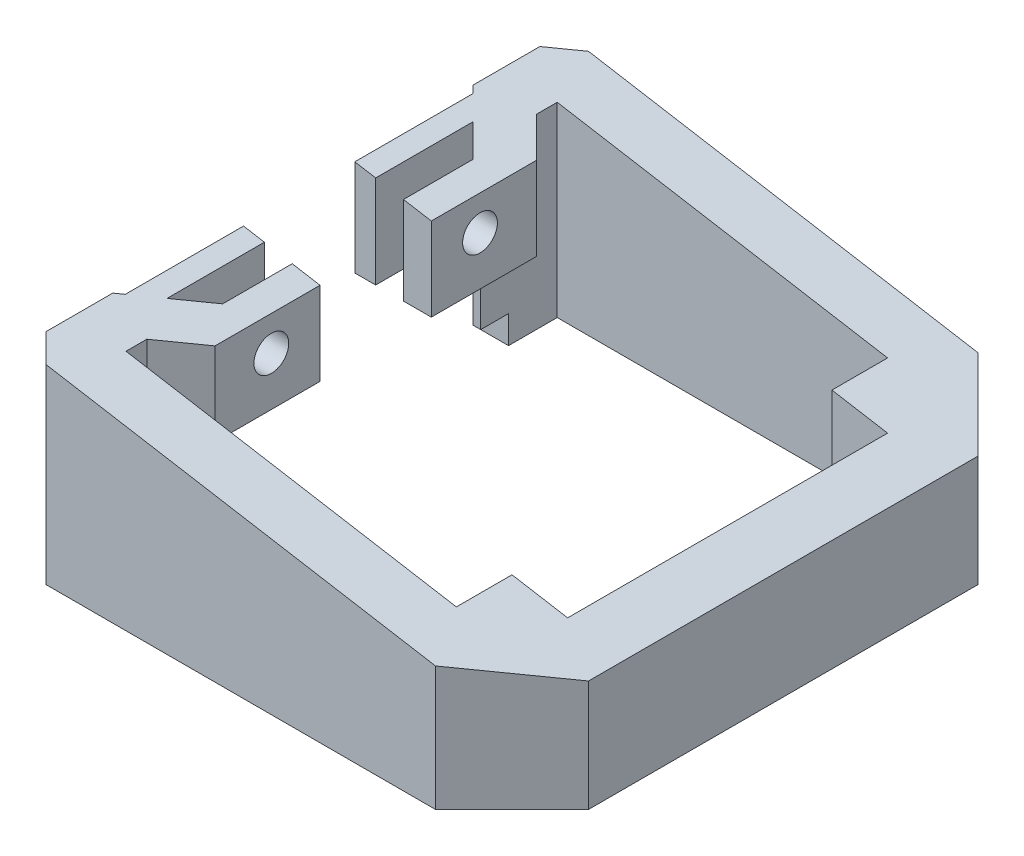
ISO-10303-21;
HEADER;
FILE_DESCRIPTION(('STEP AP214'),'2;1');
FILE_NAME('part.step','',(''),(''),'','','');
FILE_SCHEMA(('AUTOMOTIVE_DESIGN { 1 0 10303 214 1 1 1 1 }'));
ENDSEC;
DATA;
#1=APPLICATION_CONTEXT('core data for automotive mechanical design processes');
#2=APPLICATION_PROTOCOL_DEFINITION('international standard','automotive_design',2000,#1);
#3=PRODUCT_CONTEXT('',#1,'mechanical');
#4=PRODUCT('Part','Part','',(#3));
#5=PRODUCT_RELATED_PRODUCT_CATEGORY('part','',(#4));
#6=PRODUCT_DEFINITION_FORMATION('','',#4);
#7=PRODUCT_DEFINITION_CONTEXT('part definition',#1,'design');
#8=PRODUCT_DEFINITION('design','',#6,#7);
#9=PRODUCT_DEFINITION_SHAPE('','',#8);
#10=(LENGTH_UNIT() NAMED_UNIT(*) SI_UNIT(.MILLI.,.METRE.));
#11=(NAMED_UNIT(*) PLANE_ANGLE_UNIT() SI_UNIT($,.RADIAN.));
#12=(NAMED_UNIT(*) SI_UNIT($,.STERADIAN.) SOLID_ANGLE_UNIT());
#13=UNCERTAINTY_MEASURE_WITH_UNIT(LENGTH_MEASURE(1.E-05),#10,'distance_accuracy_value','');
#14=(GEOMETRIC_REPRESENTATION_CONTEXT(3) GLOBAL_UNCERTAINTY_ASSIGNED_CONTEXT((#13)) GLOBAL_UNIT_ASSIGNED_CONTEXT((#10,
#11,#12)) REPRESENTATION_CONTEXT('',''));
#15=CARTESIAN_POINT('',(0.,0.,0.));
#16=DIRECTION('',(0.,0.,1.));
#17=DIRECTION('',(1.,0.,0.));
#18=AXIS2_PLACEMENT_3D('',#15,#16,#17);
#19=CARTESIAN_POINT('',(1.2,35.6252074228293,3.99999999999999));
#20=DIRECTION('',(0.,0.,-1.));
#21=DIRECTION('',(-1.,0.,0.));
#22=AXIS2_PLACEMENT_3D('',#19,#20,#21);
#23=PLANE('',#22);
#24=DIRECTION('',(-1.,0.,0.));
#25=VECTOR('',#24,1.);
#26=CARTESIAN_POINT('',(1.2,2.,3.99999999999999));
#27=LINE('',#26,#25);
#28=CARTESIAN_POINT('',(1.75,2.,3.99999999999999));
#29=VERTEX_POINT('',#28);
#30=CARTESIAN_POINT('',(1.2,2.,3.99999999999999));
#31=VERTEX_POINT('',#30);
#32=EDGE_CURVE('E344',#29,#31,#27,.T.);
#33=ORIENTED_EDGE('',*,*,#32,.F.);
#34=DIRECTION('',(0.,-1.,0.));
#35=VECTOR('',#34,1.);
#36=CARTESIAN_POINT('',(1.75,35.6252074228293,3.99999999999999));
#37=LINE('',#36,#35);
#38=CARTESIAN_POINT('',(1.75,7.,3.99999999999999));
#39=VERTEX_POINT('',#38);
#40=EDGE_CURVE('E385',#39,#29,#37,.T.);
#41=ORIENTED_EDGE('',*,*,#40,.F.);
#42=DIRECTION('',(-1.,0.,0.));
#43=VECTOR('',#42,1.);
#44=CARTESIAN_POINT('',(1.2,7.,3.99999999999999));
#45=LINE('',#44,#43);
#46=CARTESIAN_POINT('',(1.2,7.,3.99999999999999));
#47=VERTEX_POINT('',#46);
#48=EDGE_CURVE('E352',#39,#47,#45,.T.);
#49=ORIENTED_EDGE('',*,*,#48,.T.);
#50=DIRECTION('',(0.,-1.,0.));
#51=VECTOR('',#50,1.);
#52=CARTESIAN_POINT('',(1.2,35.6252074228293,3.99999999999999));
#53=LINE('',#52,#51);
#54=EDGE_CURVE('E380',#47,#31,#53,.T.);
#55=ORIENTED_EDGE('',*,*,#54,.T.);
#56=EDGE_LOOP('',(#33,#41,#49,#55));
#57=FACE_BOUND('',#56,.T.);
#58=ADVANCED_FACE('F35',(#57),#23,.F.);
#59=CARTESIAN_POINT('',(1.20000000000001,35.6252074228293,24.));
#60=DIRECTION('',(0.,0.,1.));
#61=DIRECTION('',(1.,0.,0.));
#62=AXIS2_PLACEMENT_3D('',#59,#60,#61);
#63=PLANE('',#62);
#64=DIRECTION('',(1.,0.,0.));
#65=VECTOR('',#64,1.);
#66=CARTESIAN_POINT('',(1.20000000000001,2.,24.));
#67=LINE('',#66,#65);
#68=CARTESIAN_POINT('',(1.20000000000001,2.,24.));
#69=VERTEX_POINT('',#68);
#70=CARTESIAN_POINT('',(1.75,2.,24.));
#71=VERTEX_POINT('',#70);
#72=EDGE_CURVE('E319',#69,#71,#67,.T.);
#73=ORIENTED_EDGE('',*,*,#72,.F.);
#74=DIRECTION('',(0.,-1.,0.));
#75=VECTOR('',#74,1.);
#76=CARTESIAN_POINT('',(1.20000000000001,35.6252074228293,24.));
#77=LINE('',#76,#75);
#78=CARTESIAN_POINT('',(1.20000000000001,7.,24.));
#79=VERTEX_POINT('',#78);
#80=EDGE_CURVE('E353',#79,#69,#77,.T.);
#81=ORIENTED_EDGE('',*,*,#80,.F.);
#82=DIRECTION('',(1.,0.,0.));
#83=VECTOR('',#82,1.);
#84=CARTESIAN_POINT('',(1.20000000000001,7.,24.));
#85=LINE('',#84,#83);
#86=CARTESIAN_POINT('',(1.75,7.,24.));
#87=VERTEX_POINT('',#86);
#88=EDGE_CURVE('E370',#79,#87,#85,.T.);
#89=ORIENTED_EDGE('',*,*,#88,.T.);
#90=DIRECTION('',(0.,-1.,0.));
#91=VECTOR('',#90,1.);
#92=CARTESIAN_POINT('',(1.75,35.6252074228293,24.));
#93=LINE('',#92,#91);
#94=EDGE_CURVE('E383',#87,#71,#93,.T.);
#95=ORIENTED_EDGE('',*,*,#94,.T.);
#96=EDGE_LOOP('',(#73,#81,#89,#95));
#97=FACE_BOUND('',#96,.T.);
#98=ADVANCED_FACE('F760',(#97),#63,.F.);
#99=CARTESIAN_POINT('',(-1.29999999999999,7.,4.45000000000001));
#100=DIRECTION('',(1.,0.,0.));
#101=DIRECTION('',(0.,0.,-1.));
#102=AXIS2_PLACEMENT_3D('',#99,#100,#101);
#103=PLANE('',#102);
#104=CARTESIAN_POINT('',(-1.29999999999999,10.5,6.5));
#105=DIRECTION('',(1.,0.,0.));
#106=DIRECTION('',(0.,0.,-1.));
#107=AXIS2_PLACEMENT_3D('',#104,#105,#106);
#108=CIRCLE('',#107,0.750000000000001);
#109=CARTESIAN_POINT('',(-1.29999999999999,10.5,5.74999999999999));
#110=VERTEX_POINT('',#109);
#111=EDGE_CURVE('E484',#110,#110,#108,.T.);
#112=ORIENTED_EDGE('',*,*,#111,.T.);
#113=EDGE_LOOP('',(#112));
#114=FACE_BOUND('',#113,.T.);
#115=DIRECTION('',(0.,0.,1.));
#116=VECTOR('',#115,1.);
#117=CARTESIAN_POINT('',(-1.29999999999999,7.,1.5));
#118=LINE('',#117,#116);
#119=CARTESIAN_POINT('',(-1.29999999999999,7.,1.5));
#120=VERTEX_POINT('',#119);
#121=CARTESIAN_POINT('',(-1.29999999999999,7.,10.));
#122=VERTEX_POINT('',#121);
#123=EDGE_CURVE('E549',#120,#122,#118,.T.);
#124=ORIENTED_EDGE('',*,*,#123,.T.);
#125=DIRECTION('',(0.,-1.,0.));
#126=VECTOR('',#125,1.);
#127=CARTESIAN_POINT('',(-1.29999999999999,7.,10.));
#128=LINE('',#127,#126);
#129=CARTESIAN_POINT('',(-1.29999999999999,13.9234042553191,10.));
#130=VERTEX_POINT('',#129);
#131=EDGE_CURVE('E510',#130,#122,#128,.T.);
#132=ORIENTED_EDGE('',*,*,#131,.F.);
#133=DIRECTION('',(0.,0.,-1.));
#134=VECTOR('',#133,1.);
#135=CARTESIAN_POINT('',(-1.29999999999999,13.9234042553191,4.45000000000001));
#136=LINE('',#135,#134);
#137=CARTESIAN_POINT('',(-1.29999999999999,13.9234042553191,1.5));
#138=VERTEX_POINT('',#137);
#139=EDGE_CURVE('E445',#130,#138,#136,.T.);
#140=ORIENTED_EDGE('',*,*,#139,.T.);
#141=DIRECTION('',(0.,-1.,0.));
#142=VECTOR('',#141,1.);
#143=CARTESIAN_POINT('',(-1.29999999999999,14.,1.5));
#144=LINE('',#143,#142);
#145=EDGE_CURVE('E560',#138,#120,#144,.T.);
#146=ORIENTED_EDGE('',*,*,#145,.T.);
#147=EDGE_LOOP('',(#124,#132,#140,#146));
#148=FACE_BOUND('',#147,.T.);
#149=ADVANCED_FACE('F766',(#114,#148),#103,.F.);
#150=CARTESIAN_POINT('',(-1.29999999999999,10.5,21.5));
#151=DIRECTION('',(1.,0.,0.));
#152=DIRECTION('',(0.,0.,-1.));
#153=AXIS2_PLACEMENT_3D('',#150,#151,#152);
#154=CIRCLE('',#153,0.750000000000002);
#155=CARTESIAN_POINT('',(-1.29999999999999,10.5,20.75));
#156=VERTEX_POINT('',#155);
#157=EDGE_CURVE('E490',#156,#156,#154,.T.);
#158=ORIENTED_EDGE('',*,*,#157,.T.);
#159=EDGE_LOOP('',(#158));
#160=FACE_BOUND('',#159,.T.);
#161=DIRECTION('',(0.,1.,0.));
#162=VECTOR('',#161,1.);
#163=CARTESIAN_POINT('',(-1.29999999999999,7.,18.));
#164=LINE('',#163,#162);
#165=CARTESIAN_POINT('',(-1.29999999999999,7.,18.));
#166=VERTEX_POINT('',#165);
#167=CARTESIAN_POINT('',(-1.29999999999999,13.9234042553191,18.));
#168=VERTEX_POINT('',#167);
#169=EDGE_CURVE('E503',#166,#168,#164,.T.);
#170=ORIENTED_EDGE('',*,*,#169,.F.);
#171=CARTESIAN_POINT('',(-1.29999999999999,7.,26.5));
#172=VERTEX_POINT('',#171);
#173=EDGE_CURVE('E545',#166,#172,#118,.T.);
#174=ORIENTED_EDGE('',*,*,#173,.T.);
#175=DIRECTION('',(0.,-1.,0.));
#176=VECTOR('',#175,1.);
#177=CARTESIAN_POINT('',(-1.29999999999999,14.,26.5));
#178=LINE('',#177,#176);
#179=CARTESIAN_POINT('',(-1.29999999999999,13.9234042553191,26.5));
#180=VERTEX_POINT('',#179);
#181=EDGE_CURVE('E557',#180,#172,#178,.T.);
#182=ORIENTED_EDGE('',*,*,#181,.F.);
#183=DIRECTION('',(0.,0.,-1.));
#184=VECTOR('',#183,1.);
#185=CARTESIAN_POINT('',(-1.29999999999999,13.9234042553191,4.45000000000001));
#186=LINE('',#185,#184);
#187=EDGE_CURVE('E463',#180,#168,#186,.T.);
#188=ORIENTED_EDGE('',*,*,#187,.T.);
#189=EDGE_LOOP('',(#170,#174,#182,#188));
#190=FACE_BOUND('',#189,.T.);
#191=ADVANCED_FACE('F856',(#160,#190),#103,.F.);
#192=CARTESIAN_POINT('',(4.2,7.,2.45));
#193=DIRECTION('',(1.,0.,0.));
#194=DIRECTION('',(0.,0.,-1.));
#195=AXIS2_PLACEMENT_3D('',#192,#193,#194);
#196=PLANE('',#195);
#197=CARTESIAN_POINT('',(4.2,10.5,6.5));
#198=DIRECTION('',(1.,0.,0.));
#199=DIRECTION('',(0.,0.,-1.));
#200=AXIS2_PLACEMENT_3D('',#197,#198,#199);
#201=CIRCLE('',#200,1.25);
#202=CARTESIAN_POINT('',(4.2,10.5,5.25));
#203=VERTEX_POINT('',#202);
#204=EDGE_CURVE('E513',#203,#203,#201,.T.);
#205=ORIENTED_EDGE('',*,*,#204,.F.);
#206=EDGE_LOOP('',(#205));
#207=FACE_BOUND('',#206,.T.);
#208=DIRECTION('',(0.,-1.,0.));
#209=VECTOR('',#208,1.);
#210=CARTESIAN_POINT('',(4.2,14.,10.));
#211=LINE('',#210,#209);
#212=CARTESIAN_POINT('',(4.2,12.9872340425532,10.));
#213=VERTEX_POINT('',#212);
#214=CARTESIAN_POINT('',(4.2,7.,10.));
#215=VERTEX_POINT('',#214);
#216=EDGE_CURVE('E493',#213,#215,#211,.T.);
#217=ORIENTED_EDGE('',*,*,#216,.T.);
#218=DIRECTION('',(0.,0.,-1.));
#219=VECTOR('',#218,1.);
#220=CARTESIAN_POINT('',(4.2,7.,25.55));
#221=LINE('',#220,#219);
#222=CARTESIAN_POINT('',(4.2,7.,2.45));
#223=VERTEX_POINT('',#222);
#224=EDGE_CURVE('E361',#215,#223,#221,.T.);
#225=ORIENTED_EDGE('',*,*,#224,.T.);
#226=DIRECTION('',(0.,-1.,0.));
#227=VECTOR('',#226,1.);
#228=CARTESIAN_POINT('',(4.2,7.,2.45));
#229=LINE('',#228,#227);
#230=CARTESIAN_POINT('',(4.2,12.9872340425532,2.45));
#231=VERTEX_POINT('',#230);
#232=EDGE_CURVE('E620',#231,#223,#229,.T.);
#233=ORIENTED_EDGE('',*,*,#232,.F.);
#234=DIRECTION('',(0.,0.,-1.));
#235=VECTOR('',#234,1.);
#236=CARTESIAN_POINT('',(4.2,12.9872340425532,2.45));
#237=LINE('',#236,#235);
#238=EDGE_CURVE('E412',#213,#231,#237,.T.);
#239=ORIENTED_EDGE('',*,*,#238,.F.);
#240=EDGE_LOOP('',(#217,#225,#233,#239));
#241=FACE_BOUND('',#240,.T.);
#242=ADVANCED_FACE('F853',(#207,#241),#196,.T.);
#243=CARTESIAN_POINT('',(4.2,10.5,21.5));
#244=DIRECTION('',(1.,0.,0.));
#245=DIRECTION('',(0.,0.,-1.));
#246=AXIS2_PLACEMENT_3D('',#243,#244,#245);
#247=CIRCLE('',#246,1.25);
#248=CARTESIAN_POINT('',(4.2,10.5,20.25));
#249=VERTEX_POINT('',#248);
#250=EDGE_CURVE('E517',#249,#249,#247,.T.);
#251=ORIENTED_EDGE('',*,*,#250,.F.);
#252=EDGE_LOOP('',(#251));
#253=FACE_BOUND('',#252,.T.);
#254=DIRECTION('',(0.,-1.,0.));
#255=VECTOR('',#254,1.);
#256=CARTESIAN_POINT('',(4.2,7.,25.55));
#257=LINE('',#256,#255);
#258=CARTESIAN_POINT('',(4.2,12.9872340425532,25.55));
#259=VERTEX_POINT('',#258);
#260=CARTESIAN_POINT('',(4.2,7.,25.55));
#261=VERTEX_POINT('',#260);
#262=EDGE_CURVE('E617',#259,#261,#257,.T.);
#263=ORIENTED_EDGE('',*,*,#262,.T.);
#264=CARTESIAN_POINT('',(4.2,7.,18.));
#265=VERTEX_POINT('',#264);
#266=EDGE_CURVE('E362',#261,#265,#221,.T.);
#267=ORIENTED_EDGE('',*,*,#266,.T.);
#268=DIRECTION('',(0.,1.,0.));
#269=VECTOR('',#268,1.);
#270=CARTESIAN_POINT('',(4.20000000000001,14.,18.));
#271=LINE('',#270,#269);
#272=CARTESIAN_POINT('',(4.2,12.9872340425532,18.));
#273=VERTEX_POINT('',#272);
#274=EDGE_CURVE('E496',#265,#273,#271,.T.);
#275=ORIENTED_EDGE('',*,*,#274,.T.);
#276=DIRECTION('',(0.,0.,-1.));
#277=VECTOR('',#276,1.);
#278=CARTESIAN_POINT('',(4.2,12.9872340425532,2.45));
#279=LINE('',#278,#277);
#280=EDGE_CURVE('E442',#259,#273,#279,.T.);
#281=ORIENTED_EDGE('',*,*,#280,.F.);
#282=EDGE_LOOP('',(#263,#267,#275,#281));
#283=FACE_BOUND('',#282,.T.);
#284=ADVANCED_FACE('F821',(#253,#283),#196,.T.);
#285=CARTESIAN_POINT('',(0.200000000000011,7.,5.95000000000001));
#286=DIRECTION('',(1.,0.,0.));
#287=DIRECTION('',(0.,0.,-1.));
#288=AXIS2_PLACEMENT_3D('',#285,#286,#287);
#289=PLANE('',#288);
#290=CARTESIAN_POINT('',(0.200000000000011,10.5,6.5));
#291=DIRECTION('',(1.,0.,0.));
#292=DIRECTION('',(0.,0.,-1.));
#293=AXIS2_PLACEMENT_3D('',#290,#291,#292);
#294=CIRCLE('',#293,0.750000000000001);
#295=CARTESIAN_POINT('',(0.200000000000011,10.5,5.74999999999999));
#296=VERTEX_POINT('',#295);
#297=EDGE_CURVE('E481',#296,#296,#294,.T.);
#298=ORIENTED_EDGE('',*,*,#297,.F.);
#299=EDGE_LOOP('',(#298));
#300=FACE_BOUND('',#299,.T.);
#301=DIRECTION('',(0.,-1.,0.));
#302=VECTOR('',#301,1.);
#303=CARTESIAN_POINT('',(0.200000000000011,7.,10.));
#304=LINE('',#303,#302);
#305=CARTESIAN_POINT('',(0.200000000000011,13.668085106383,10.));
#306=VERTEX_POINT('',#305);
#307=CARTESIAN_POINT('',(0.200000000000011,7.,10.));
#308=VERTEX_POINT('',#307);
#309=EDGE_CURVE('E507',#306,#308,#304,.T.);
#310=ORIENTED_EDGE('',*,*,#309,.T.);
#311=DIRECTION('',(0.,0.,1.));
#312=VECTOR('',#311,1.);
#313=CARTESIAN_POINT('',(0.200000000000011,7.,3.));
#314=LINE('',#313,#312);
#315=CARTESIAN_POINT('',(0.200000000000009,7.,3.));
#316=VERTEX_POINT('',#315);
#317=EDGE_CURVE('E528',#316,#308,#314,.T.);
#318=ORIENTED_EDGE('',*,*,#317,.F.);
#319=DIRECTION('',(0.,-1.,0.));
#320=VECTOR('',#319,1.);
#321=CARTESIAN_POINT('',(0.200000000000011,14.,3.));
#322=LINE('',#321,#320);
#323=CARTESIAN_POINT('',(0.200000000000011,13.668085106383,3.));
#324=VERTEX_POINT('',#323);
#325=EDGE_CURVE('E542',#324,#316,#322,.T.);
#326=ORIENTED_EDGE('',*,*,#325,.F.);
#327=DIRECTION('',(0.,0.,-1.));
#328=VECTOR('',#327,1.);
#329=CARTESIAN_POINT('',(0.200000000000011,13.668085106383,5.95000000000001));
#330=LINE('',#329,#328);
#331=EDGE_CURVE('E422',#306,#324,#330,.T.);
#332=ORIENTED_EDGE('',*,*,#331,.F.);
#333=EDGE_LOOP('',(#310,#318,#326,#332));
#334=FACE_BOUND('',#333,.T.);
#335=ADVANCED_FACE('F818',(#300,#334),#289,.T.);
#336=CARTESIAN_POINT('',(0.200000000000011,10.5,21.5));
#337=DIRECTION('',(1.,0.,0.));
#338=DIRECTION('',(0.,0.,-1.));
#339=AXIS2_PLACEMENT_3D('',#336,#337,#338);
#340=CIRCLE('',#339,0.750000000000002);
#341=CARTESIAN_POINT('',(0.200000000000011,10.5,20.75));
#342=VERTEX_POINT('',#341);
#343=EDGE_CURVE('E487',#342,#342,#340,.T.);
#344=ORIENTED_EDGE('',*,*,#343,.F.);
#345=EDGE_LOOP('',(#344));
#346=FACE_BOUND('',#345,.T.);
#347=CARTESIAN_POINT('',(0.200000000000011,7.,18.));
#348=VERTEX_POINT('',#347);
#349=CARTESIAN_POINT('',(0.200000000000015,7.,25.));
#350=VERTEX_POINT('',#349);
#351=EDGE_CURVE('E527',#348,#350,#314,.T.);
#352=ORIENTED_EDGE('',*,*,#351,.F.);
#353=DIRECTION('',(0.,1.,0.));
#354=VECTOR('',#353,1.);
#355=CARTESIAN_POINT('',(0.200000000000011,7.,18.));
#356=LINE('',#355,#354);
#357=CARTESIAN_POINT('',(0.200000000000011,13.668085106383,18.));
#358=VERTEX_POINT('',#357);
#359=EDGE_CURVE('E501',#348,#358,#356,.T.);
#360=ORIENTED_EDGE('',*,*,#359,.T.);
#361=DIRECTION('',(0.,0.,-1.));
#362=VECTOR('',#361,1.);
#363=CARTESIAN_POINT('',(0.200000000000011,13.668085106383,5.95000000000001));
#364=LINE('',#363,#362);
#365=CARTESIAN_POINT('',(0.200000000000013,13.668085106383,25.));
#366=VERTEX_POINT('',#365);
#367=EDGE_CURVE('E457',#366,#358,#364,.T.);
#368=ORIENTED_EDGE('',*,*,#367,.F.);
#369=DIRECTION('',(0.,-1.,0.));
#370=VECTOR('',#369,1.);
#371=CARTESIAN_POINT('',(0.200000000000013,14.,25.));
#372=LINE('',#371,#370);
#373=EDGE_CURVE('E539',#366,#350,#372,.T.);
#374=ORIENTED_EDGE('',*,*,#373,.T.);
#375=EDGE_LOOP('',(#352,#360,#368,#374));
#376=FACE_BOUND('',#375,.T.);
#377=ADVANCED_FACE('F816',(#346,#376),#289,.T.);
#378=CARTESIAN_POINT('',(2.20000000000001,7.,20.05));
#379=DIRECTION('',(-1.,0.,0.));
#380=DIRECTION('',(0.,0.,1.));
#381=AXIS2_PLACEMENT_3D('',#378,#379,#380);
#382=PLANE('',#381);
#383=CARTESIAN_POINT('',(2.2,10.5,6.5));
#384=DIRECTION('',(1.,0.,0.));
#385=DIRECTION('',(0.,0.,-1.));
#386=AXIS2_PLACEMENT_3D('',#383,#384,#385);
#387=CIRCLE('',#386,1.25);
#388=CARTESIAN_POINT('',(2.2,10.5,5.25));
#389=VERTEX_POINT('',#388);
#390=EDGE_CURVE('E514',#389,#389,#387,.T.);
#391=ORIENTED_EDGE('',*,*,#390,.T.);
#392=EDGE_LOOP('',(#391));
#393=FACE_BOUND('',#392,.T.);
#394=DIRECTION('',(0.,0.,-1.));
#395=VECTOR('',#394,1.);
#396=CARTESIAN_POINT('',(2.20000000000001,7.,5.));
#397=LINE('',#396,#395);
#398=CARTESIAN_POINT('',(2.20000000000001,7.,10.));
#399=VERTEX_POINT('',#398);
#400=CARTESIAN_POINT('',(2.20000000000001,7.,5.));
#401=VERTEX_POINT('',#400);
#402=EDGE_CURVE('E530',#399,#401,#397,.T.);
#403=ORIENTED_EDGE('',*,*,#402,.F.);
#404=DIRECTION('',(0.,1.,0.));
#405=VECTOR('',#404,1.);
#406=CARTESIAN_POINT('',(2.20000000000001,7.,10.));
#407=LINE('',#406,#405);
#408=CARTESIAN_POINT('',(2.20000000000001,13.3276595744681,10.));
#409=VERTEX_POINT('',#408);
#410=EDGE_CURVE('E505',#399,#409,#407,.T.);
#411=ORIENTED_EDGE('',*,*,#410,.T.);
#412=DIRECTION('',(0.,0.,1.));
#413=VECTOR('',#412,1.);
#414=CARTESIAN_POINT('',(2.20000000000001,13.3276595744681,20.05));
#415=LINE('',#414,#413);
#416=CARTESIAN_POINT('',(2.20000000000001,13.3276595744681,5.));
#417=VERTEX_POINT('',#416);
#418=EDGE_CURVE('E409',#417,#409,#415,.T.);
#419=ORIENTED_EDGE('',*,*,#418,.F.);
#420=DIRECTION('',(0.,-1.,0.));
#421=VECTOR('',#420,1.);
#422=CARTESIAN_POINT('',(2.20000000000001,14.,5.));
#423=LINE('',#422,#421);
#424=EDGE_CURVE('E533',#417,#401,#423,.T.);
#425=ORIENTED_EDGE('',*,*,#424,.T.);
#426=EDGE_LOOP('',(#403,#411,#419,#425));
#427=FACE_BOUND('',#426,.T.);
#428=ADVANCED_FACE('F812',(#393,#427),#382,.T.);
#429=CARTESIAN_POINT('',(2.2,10.5,21.5));
#430=DIRECTION('',(1.,0.,0.));
#431=DIRECTION('',(0.,0.,-1.));
#432=AXIS2_PLACEMENT_3D('',#429,#430,#431);
#433=CIRCLE('',#432,1.25);
#434=CARTESIAN_POINT('',(2.2,10.5,20.25));
#435=VERTEX_POINT('',#434);
#436=EDGE_CURVE('E520',#435,#435,#433,.T.);
#437=ORIENTED_EDGE('',*,*,#436,.T.);
#438=EDGE_LOOP('',(#437));
#439=FACE_BOUND('',#438,.T.);
#440=DIRECTION('',(0.,-1.,0.));
#441=VECTOR('',#440,1.);
#442=CARTESIAN_POINT('',(2.20000000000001,7.,18.));
#443=LINE('',#442,#441);
#444=CARTESIAN_POINT('',(2.20000000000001,13.3276595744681,18.));
#445=VERTEX_POINT('',#444);
#446=CARTESIAN_POINT('',(2.20000000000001,7.,18.));
#447=VERTEX_POINT('',#446);
#448=EDGE_CURVE('E498',#445,#447,#443,.T.);
#449=ORIENTED_EDGE('',*,*,#448,.T.);
#450=CARTESIAN_POINT('',(2.20000000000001,7.,23.));
#451=VERTEX_POINT('',#450);
#452=EDGE_CURVE('E531',#451,#447,#397,.T.);
#453=ORIENTED_EDGE('',*,*,#452,.F.);
#454=DIRECTION('',(0.,-1.,0.));
#455=VECTOR('',#454,1.);
#456=CARTESIAN_POINT('',(2.20000000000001,14.,23.));
#457=LINE('',#456,#455);
#458=CARTESIAN_POINT('',(2.20000000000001,13.3276595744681,23.));
#459=VERTEX_POINT('',#458);
#460=EDGE_CURVE('E536',#459,#451,#457,.T.);
#461=ORIENTED_EDGE('',*,*,#460,.F.);
#462=DIRECTION('',(0.,0.,1.));
#463=VECTOR('',#462,1.);
#464=CARTESIAN_POINT('',(2.20000000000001,13.3276595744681,20.05));
#465=LINE('',#464,#463);
#466=EDGE_CURVE('E453',#445,#459,#465,.T.);
#467=ORIENTED_EDGE('',*,*,#466,.F.);
#468=EDGE_LOOP('',(#449,#453,#461,#467));
#469=FACE_BOUND('',#468,.T.);
#470=ADVANCED_FACE('F815',(#439,#469),#382,.T.);
#471=CARTESIAN_POINT('',(1.75,7.,0.));
#472=DIRECTION('',(0.707106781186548,0.,-0.707106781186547));
#473=DIRECTION('',(-0.707106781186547,0.,-0.707106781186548));
#474=AXIS2_PLACEMENT_3D('',#471,#472,#473);
#475=PLANE('',#474);
#476=ORIENTED_EDGE('',*,*,#232,.T.);
#477=DIRECTION('',(-0.707106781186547,0.,-0.707106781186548));
#478=VECTOR('',#477,1.);
#479=CARTESIAN_POINT('',(4.2,7.,2.45));
#480=LINE('',#479,#478);
#481=CARTESIAN_POINT('',(1.75,7.,0.));
#482=VERTEX_POINT('',#481);
#483=EDGE_CURVE('E358',#223,#482,#480,.T.);
#484=ORIENTED_EDGE('',*,*,#483,.T.);
#485=DIRECTION('',(0.,-1.,0.));
#486=VECTOR('',#485,1.);
#487=CARTESIAN_POINT('',(1.75,7.,0.));
#488=LINE('',#487,#486);
#489=CARTESIAN_POINT('',(1.75,13.4042553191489,0.));
#490=VERTEX_POINT('',#489);
#491=EDGE_CURVE('E623',#490,#482,#488,.T.);
#492=ORIENTED_EDGE('',*,*,#491,.F.);
#493=DIRECTION('',(-0.702040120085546,0.119496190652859,-0.702040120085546));
#494=VECTOR('',#493,1.);
#495=CARTESIAN_POINT('',(2.28726015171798,13.3128067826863,0.537260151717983));
#496=LINE('',#495,#494);
#497=EDGE_CURVE('E416',#231,#490,#496,.T.);
#498=ORIENTED_EDGE('',*,*,#497,.F.);
#499=EDGE_LOOP('',(#476,#484,#492,#498));
#500=FACE_BOUND('',#499,.T.);
#501=ADVANCED_FACE('F851',(#500),#475,.T.);
#502=CARTESIAN_POINT('',(1.75,7.,28.));
#503=DIRECTION('',(0.707106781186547,0.,0.707106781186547));
#504=DIRECTION('',(0.707106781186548,0.,-0.707106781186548));
#505=AXIS2_PLACEMENT_3D('',#502,#503,#504);
#506=PLANE('',#505);
#507=DIRECTION('',(0.,-1.,0.));
#508=VECTOR('',#507,1.);
#509=CARTESIAN_POINT('',(1.75,7.,28.));
#510=LINE('',#509,#508);
#511=CARTESIAN_POINT('',(1.75,13.4042553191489,28.));
#512=VERTEX_POINT('',#511);
#513=CARTESIAN_POINT('',(1.75,7.,28.));
#514=VERTEX_POINT('',#513);
#515=EDGE_CURVE('E614',#512,#514,#510,.T.);
#516=ORIENTED_EDGE('',*,*,#515,.T.);
#517=DIRECTION('',(0.707106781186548,0.,-0.707106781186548));
#518=VECTOR('',#517,1.);
#519=CARTESIAN_POINT('',(1.75,7.,28.));
#520=LINE('',#519,#518);
#521=EDGE_CURVE('E365',#514,#261,#520,.T.);
#522=ORIENTED_EDGE('',*,*,#521,.T.);
#523=ORIENTED_EDGE('',*,*,#262,.F.);
#524=DIRECTION('',(0.702040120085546,-0.119496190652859,-0.702040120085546));
#525=VECTOR('',#524,1.);
#526=CARTESIAN_POINT('',(2.28726015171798,13.3128067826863,27.462739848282));
#527=LINE('',#526,#525);
#528=EDGE_CURVE('E440',#512,#259,#527,.T.);
#529=ORIENTED_EDGE('',*,*,#528,.F.);
#530=EDGE_LOOP('',(#516,#522,#523,#529));
#531=FACE_BOUND('',#530,.T.);
#532=ADVANCED_FACE('F787',(#531),#506,.T.);
#533=CARTESIAN_POINT('',(-3.79999999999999,14.,18.));
#534=DIRECTION('',(0.,0.,-1.));
#535=DIRECTION('',(-1.,0.,0.));
#536=AXIS2_PLACEMENT_3D('',#533,#534,#535);
#537=PLANE('',#536);
#538=ORIENTED_EDGE('',*,*,#274,.F.);
#539=DIRECTION('',(-1.,0.,0.));
#540=VECTOR('',#539,1.);
#541=CARTESIAN_POINT('',(-3.79999999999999,7.,18.));
#542=LINE('',#541,#540);
#543=EDGE_CURVE('E395',#265,#447,#542,.T.);
#544=ORIENTED_EDGE('',*,*,#543,.T.);
#545=ORIENTED_EDGE('',*,*,#448,.F.);
#546=DIRECTION('',(-0.985821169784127,0.167799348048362,0.));
#547=VECTOR('',#546,1.);
#548=CARTESIAN_POINT('',(-3.74227892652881,14.3391113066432,18.));
#549=LINE('',#548,#547);
#550=EDGE_CURVE('E448',#273,#445,#549,.T.);
#551=ORIENTED_EDGE('',*,*,#550,.F.);
#552=EDGE_LOOP('',(#538,#544,#545,#551));
#553=FACE_BOUND('',#552,.T.);
#554=ADVANCED_FACE('F783',(#553),#537,.T.);
#555=ORIENTED_EDGE('',*,*,#359,.F.);
#556=DIRECTION('',(-1.,0.,0.));
#557=VECTOR('',#556,1.);
#558=CARTESIAN_POINT('',(-3.79999999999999,7.,18.));
#559=LINE('',#558,#557);
#560=EDGE_CURVE('E392',#348,#166,#559,.T.);
#561=ORIENTED_EDGE('',*,*,#560,.T.);
#562=ORIENTED_EDGE('',*,*,#169,.T.);
#563=DIRECTION('',(-0.985821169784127,0.167799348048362,0.));
#564=VECTOR('',#563,1.);
#565=CARTESIAN_POINT('',(-3.74227892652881,14.3391113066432,18.));
#566=LINE('',#565,#564);
#567=EDGE_CURVE('E460',#358,#168,#566,.T.);
#568=ORIENTED_EDGE('',*,*,#567,.F.);
#569=EDGE_LOOP('',(#555,#561,#562,#568));
#570=FACE_BOUND('',#569,.T.);
#571=ADVANCED_FACE('F786',(#570),#537,.T.);
#572=CARTESIAN_POINT('',(-3.79999999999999,14.,10.));
#573=DIRECTION('',(0.,0.,1.));
#574=DIRECTION('',(0.,-1.,0.));
#575=AXIS2_PLACEMENT_3D('',#572,#573,#574);
#576=PLANE('',#575);
#577=ORIENTED_EDGE('',*,*,#131,.T.);
#578=DIRECTION('',(1.,0.,0.));
#579=VECTOR('',#578,1.);
#580=CARTESIAN_POINT('',(-3.79999999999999,7.,10.));
#581=LINE('',#580,#579);
#582=EDGE_CURVE('E375',#122,#308,#581,.T.);
#583=ORIENTED_EDGE('',*,*,#582,.T.);
#584=ORIENTED_EDGE('',*,*,#309,.F.);
#585=DIRECTION('',(0.985821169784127,-0.167799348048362,0.));
#586=VECTOR('',#585,1.);
#587=CARTESIAN_POINT('',(-3.74227892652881,14.3391113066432,10.));
#588=LINE('',#587,#586);
#589=EDGE_CURVE('E424',#130,#306,#588,.T.);
#590=ORIENTED_EDGE('',*,*,#589,.F.);
#591=EDGE_LOOP('',(#577,#583,#584,#590));
#592=FACE_BOUND('',#591,.T.);
#593=ADVANCED_FACE('F789',(#592),#576,.T.);
#594=ORIENTED_EDGE('',*,*,#410,.F.);
#595=DIRECTION('',(1.,0.,0.));
#596=VECTOR('',#595,1.);
#597=CARTESIAN_POINT('',(-3.79999999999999,7.,10.));
#598=LINE('',#597,#596);
#599=EDGE_CURVE('E685',#399,#215,#598,.T.);
#600=ORIENTED_EDGE('',*,*,#599,.T.);
#601=ORIENTED_EDGE('',*,*,#216,.F.);
#602=DIRECTION('',(0.985821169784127,-0.167799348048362,0.));
#603=VECTOR('',#602,1.);
#604=CARTESIAN_POINT('',(-3.74227892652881,14.3391113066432,10.));
#605=LINE('',#604,#603);
#606=EDGE_CURVE('E683',#409,#213,#605,.T.);
#607=ORIENTED_EDGE('',*,*,#606,.F.);
#608=EDGE_LOOP('',(#594,#600,#601,#607));
#609=FACE_BOUND('',#608,.T.);
#610=ADVANCED_FACE('F792',(#609),#576,.T.);
#611=CARTESIAN_POINT('',(0.,0.,0.));
#612=DIRECTION('',(0.,-1.,0.));
#613=DIRECTION('',(0.,0.,-1.));
#614=AXIS2_PLACEMENT_3D('',#611,#612,#613);
#615=PLANE('',#614);
#616=DIRECTION('',(1.,0.,0.));
#617=VECTOR('',#616,1.);
#618=CARTESIAN_POINT('',(1.75,0.,1.99999999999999));
#619=LINE('',#618,#617);
#620=CARTESIAN_POINT('',(-0.799999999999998,0.,1.99999999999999));
#621=VERTEX_POINT('',#620);
#622=CARTESIAN_POINT('',(1.75,0.,1.99999999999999));
#623=VERTEX_POINT('',#622);
#624=EDGE_CURVE('E324',#621,#623,#619,.T.);
#625=ORIENTED_EDGE('',*,*,#624,.F.);
#626=DIRECTION('',(0.707106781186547,0.,0.707106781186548));
#627=VECTOR('',#626,1.);
#628=CARTESIAN_POINT('',(-1.74999999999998,0.,1.05000000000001));
#629=LINE('',#628,#627);
#630=CARTESIAN_POINT('',(-1.74999999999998,0.,1.05000000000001));
#631=VERTEX_POINT('',#630);
#632=EDGE_CURVE('E348',#631,#621,#629,.T.);
#633=ORIENTED_EDGE('',*,*,#632,.F.);
#634=DIRECTION('',(0.,0.,1.));
#635=VECTOR('',#634,1.);
#636=CARTESIAN_POINT('',(-1.75,0.,-3.75));
#637=LINE('',#636,#635);
#638=CARTESIAN_POINT('',(-1.75,0.,-3.75));
#639=VERTEX_POINT('',#638);
#640=EDGE_CURVE('E648',#639,#631,#637,.T.);
#641=ORIENTED_EDGE('',*,*,#640,.F.);
#642=DIRECTION('',(-0.707106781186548,0.,0.707106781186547));
#643=VECTOR('',#642,1.);
#644=CARTESIAN_POINT('',(-1.75,0.,-3.75));
#645=LINE('',#644,#643);
#646=CARTESIAN_POINT('',(0.,0.,-5.5));
#647=VERTEX_POINT('',#646);
#648=EDGE_CURVE('E646',#647,#639,#645,.T.);
#649=ORIENTED_EDGE('',*,*,#648,.F.);
#650=DIRECTION('',(-1.,0.,0.));
#651=VECTOR('',#650,1.);
#652=CARTESIAN_POINT('',(0.,0.,-5.5));
#653=LINE('',#652,#651);
#654=CARTESIAN_POINT('',(28.,0.,-5.5));
#655=VERTEX_POINT('',#654);
#656=EDGE_CURVE('E643',#655,#647,#653,.T.);
#657=ORIENTED_EDGE('',*,*,#656,.F.);
#658=DIRECTION('',(-0.707106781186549,0.,-0.707106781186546));
#659=VECTOR('',#658,1.);
#660=CARTESIAN_POINT('',(28.,0.,-5.5));
#661=LINE('',#660,#659);
#662=CARTESIAN_POINT('',(33.5,0.,0.));
#663=VERTEX_POINT('',#662);
#664=EDGE_CURVE('E640',#663,#655,#661,.T.);
#665=ORIENTED_EDGE('',*,*,#664,.F.);
#666=DIRECTION('',(0.,0.,-1.));
#667=VECTOR('',#666,1.);
#668=CARTESIAN_POINT('',(33.5,0.,0.));
#669=LINE('',#668,#667);
#670=CARTESIAN_POINT('',(33.5,0.,28.));
#671=VERTEX_POINT('',#670);
#672=EDGE_CURVE('E662',#671,#663,#669,.T.);
#673=ORIENTED_EDGE('',*,*,#672,.F.);
#674=DIRECTION('',(0.707106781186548,0.,-0.707106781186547));
#675=VECTOR('',#674,1.);
#676=CARTESIAN_POINT('',(33.5,0.,28.));
#677=LINE('',#676,#675);
#678=CARTESIAN_POINT('',(28.,0.,33.5));
#679=VERTEX_POINT('',#678);
#680=EDGE_CURVE('E659',#679,#671,#677,.T.);
#681=ORIENTED_EDGE('',*,*,#680,.F.);
#682=DIRECTION('',(1.,0.,0.));
#683=VECTOR('',#682,1.);
#684=CARTESIAN_POINT('',(28.,0.,33.5));
#685=LINE('',#684,#683);
#686=CARTESIAN_POINT('',(0.,0.,33.5));
#687=VERTEX_POINT('',#686);
#688=EDGE_CURVE('E656',#687,#679,#685,.T.);
#689=ORIENTED_EDGE('',*,*,#688,.F.);
#690=DIRECTION('',(0.707106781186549,0.,0.707106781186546));
#691=VECTOR('',#690,1.);
#692=CARTESIAN_POINT('',(0.,0.,33.5));
#693=LINE('',#692,#691);
#694=CARTESIAN_POINT('',(-1.75,0.,31.75));
#695=VERTEX_POINT('',#694);
#696=EDGE_CURVE('E653',#695,#687,#693,.T.);
#697=ORIENTED_EDGE('',*,*,#696,.F.);
#698=DIRECTION('',(0.,0.,1.));
#699=VECTOR('',#698,1.);
#700=CARTESIAN_POINT('',(-1.75,0.,24.));
#701=LINE('',#700,#699);
#702=CARTESIAN_POINT('',(-1.74999999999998,0.,26.95));
#703=VERTEX_POINT('',#702);
#704=EDGE_CURVE('E651',#703,#695,#701,.T.);
#705=ORIENTED_EDGE('',*,*,#704,.F.);
#706=DIRECTION('',(-0.707106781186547,0.,0.707106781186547));
#707=VECTOR('',#706,1.);
#708=CARTESIAN_POINT('',(-1.74999999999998,0.,26.95));
#709=LINE('',#708,#707);
#710=CARTESIAN_POINT('',(-0.799999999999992,0.,26.));
#711=VERTEX_POINT('',#710);
#712=EDGE_CURVE('E378',#711,#703,#709,.T.);
#713=ORIENTED_EDGE('',*,*,#712,.F.);
#714=DIRECTION('',(-1.,0.,0.));
#715=VECTOR('',#714,1.);
#716=CARTESIAN_POINT('',(1.75,0.,26.));
#717=LINE('',#716,#715);
#718=CARTESIAN_POINT('',(1.75,0.,26.));
#719=VERTEX_POINT('',#718);
#720=EDGE_CURVE('E704',#719,#711,#717,.T.);
#721=ORIENTED_EDGE('',*,*,#720,.F.);
#722=DIRECTION('',(0.,0.,1.));
#723=VECTOR('',#722,1.);
#724=CARTESIAN_POINT('',(1.75,0.,29.5));
#725=LINE('',#724,#723);
#726=CARTESIAN_POINT('',(1.75,0.,29.5));
#727=VERTEX_POINT('',#726);
#728=EDGE_CURVE('E335',#719,#727,#725,.T.);
#729=ORIENTED_EDGE('',*,*,#728,.T.);
#730=DIRECTION('',(1.,0.,0.));
#731=VECTOR('',#730,1.);
#732=CARTESIAN_POINT('',(25.5,0.,29.5));
#733=LINE('',#732,#731);
#734=CARTESIAN_POINT('',(25.5,0.,29.5));
#735=VERTEX_POINT('',#734);
#736=EDGE_CURVE('E582',#727,#735,#733,.T.);
#737=ORIENTED_EDGE('',*,*,#736,.T.);
#738=DIRECTION('',(0.,0.,-1.));
#739=VECTOR('',#738,1.);
#740=CARTESIAN_POINT('',(25.5,0.,25.5));
#741=LINE('',#740,#739);
#742=CARTESIAN_POINT('',(25.5,0.,25.5));
#743=VERTEX_POINT('',#742);
#744=EDGE_CURVE('E585',#735,#743,#741,.T.);
#745=ORIENTED_EDGE('',*,*,#744,.T.);
#746=DIRECTION('',(1.,0.,0.));
#747=VECTOR('',#746,1.);
#748=CARTESIAN_POINT('',(29.5,0.,25.5));
#749=LINE('',#748,#747);
#750=CARTESIAN_POINT('',(29.5,0.,25.5));
#751=VERTEX_POINT('',#750);
#752=EDGE_CURVE('E588',#743,#751,#749,.T.);
#753=ORIENTED_EDGE('',*,*,#752,.T.);
#754=DIRECTION('',(0.,0.,-1.));
#755=VECTOR('',#754,1.);
#756=CARTESIAN_POINT('',(29.5,0.,2.5));
#757=LINE('',#756,#755);
#758=CARTESIAN_POINT('',(29.5,0.,2.5));
#759=VERTEX_POINT('',#758);
#760=EDGE_CURVE('E591',#751,#759,#757,.T.);
#761=ORIENTED_EDGE('',*,*,#760,.T.);
#762=DIRECTION('',(-1.,0.,0.));
#763=VECTOR('',#762,1.);
#764=CARTESIAN_POINT('',(25.5,0.,2.5));
#765=LINE('',#764,#763);
#766=CARTESIAN_POINT('',(25.5,0.,2.5));
#767=VERTEX_POINT('',#766);
#768=EDGE_CURVE('E594',#759,#767,#765,.T.);
#769=ORIENTED_EDGE('',*,*,#768,.T.);
#770=DIRECTION('',(0.,0.,-1.));
#771=VECTOR('',#770,1.);
#772=CARTESIAN_POINT('',(25.5,0.,-1.5));
#773=LINE('',#772,#771);
#774=CARTESIAN_POINT('',(25.5,0.,-1.5));
#775=VERTEX_POINT('',#774);
#776=EDGE_CURVE('E597',#767,#775,#773,.T.);
#777=ORIENTED_EDGE('',*,*,#776,.T.);
#778=DIRECTION('',(-1.,0.,0.));
#779=VECTOR('',#778,1.);
#780=CARTESIAN_POINT('',(1.75,0.,-1.5));
#781=LINE('',#780,#779);
#782=CARTESIAN_POINT('',(1.75,0.,-1.5));
#783=VERTEX_POINT('',#782);
#784=EDGE_CURVE('E575',#775,#783,#781,.T.);
#785=ORIENTED_EDGE('',*,*,#784,.T.);
#786=DIRECTION('',(0.,0.,1.));
#787=VECTOR('',#786,1.);
#788=CARTESIAN_POINT('',(1.75,0.,-1.5));
#789=LINE('',#788,#787);
#790=EDGE_CURVE('E578',#783,#623,#789,.T.);
#791=ORIENTED_EDGE('',*,*,#790,.T.);
#792=EDGE_LOOP('',(#625,#633,#641,#649,#657,#665,#673,#681,#689,#697,#705,#713,#721,#729,#737,
#745,#753,#761,#769,#777,#785,#791));
#793=FACE_BOUND('',#792,.T.);
#794=CARTESIAN_POINT('',(0.,0.,28.));
#795=DIRECTION('',(0.,1.,0.));
#796=DIRECTION('',(0.,0.,1.));
#797=AXIS2_PLACEMENT_3D('',#794,#795,#796);
#798=CIRCLE('',#797,1.1);
#799=CARTESIAN_POINT('',(0.,0.,29.1));
#800=VERTEX_POINT('',#799);
#801=EDGE_CURVE('E631',#800,#800,#798,.T.);
#802=ORIENTED_EDGE('',*,*,#801,.T.);
#803=EDGE_LOOP('',(#802));
#804=FACE_BOUND('',#803,.T.);
#805=CARTESIAN_POINT('',(0.,0.,0.));
#806=DIRECTION('',(0.,1.,0.));
#807=DIRECTION('',(0.,0.,1.));
#808=AXIS2_PLACEMENT_3D('',#805,#806,#807);
#809=CIRCLE('',#808,1.1);
#810=CARTESIAN_POINT('',(0.,0.,1.1));
#811=VERTEX_POINT('',#810);
#812=EDGE_CURVE('E637',#811,#811,#809,.T.);
#813=ORIENTED_EDGE('',*,*,#812,.T.);
#814=EDGE_LOOP('',(#813));
#815=FACE_BOUND('',#814,.T.);
#816=CARTESIAN_POINT('',(28.,0.,0.));
#817=DIRECTION('',(0.,1.,0.));
#818=DIRECTION('',(0.,0.,1.));
#819=AXIS2_PLACEMENT_3D('',#816,#817,#818);
#820=CIRCLE('',#819,1.1);
#821=CARTESIAN_POINT('',(28.,0.,1.1));
#822=VERTEX_POINT('',#821);
#823=EDGE_CURVE('E634',#822,#822,#820,.T.);
#824=ORIENTED_EDGE('',*,*,#823,.T.);
#825=EDGE_LOOP('',(#824));
#826=FACE_BOUND('',#825,.T.);
#827=CARTESIAN_POINT('',(28.,0.,28.));
#828=DIRECTION('',(0.,1.,0.));
#829=DIRECTION('',(0.,0.,1.));
#830=AXIS2_PLACEMENT_3D('',#827,#828,#829);
#831=CIRCLE('',#830,1.09999999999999);
#832=CARTESIAN_POINT('',(28.,0.,29.1));
#833=VERTEX_POINT('',#832);
#834=EDGE_CURVE('E628',#833,#833,#831,.T.);
#835=ORIENTED_EDGE('',*,*,#834,.T.);
#836=EDGE_LOOP('',(#835));
#837=FACE_BOUND('',#836,.T.);
#838=ADVANCED_FACE('F700',(#793,#804,#815,#826,#837),#615,.T.);
#839=CARTESIAN_POINT('',(28.,7.,-5.5));
#840=DIRECTION('',(-0.707106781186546,0.,0.707106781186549));
#841=DIRECTION('',(0.707106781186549,0.,0.707106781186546));
#842=AXIS2_PLACEMENT_3D('',#839,#840,#841);
#843=PLANE('',#842);
#844=DIRECTION('',(0.,-1.,0.));
#845=VECTOR('',#844,1.);
#846=CARTESIAN_POINT('',(28.,7.,-5.5));
#847=LINE('',#846,#845);
#848=CARTESIAN_POINT('',(28.,8.93617021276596,-5.5));
#849=VERTEX_POINT('',#848);
#850=EDGE_CURVE('E681',#849,#655,#847,.T.);
#851=ORIENTED_EDGE('',*,*,#850,.F.);
#852=DIRECTION('',(0.702040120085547,-0.119496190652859,0.702040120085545));
#853=VECTOR('',#852,1.);
#854=CARTESIAN_POINT('',(28.1624274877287,8.90852298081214,-5.33757251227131));
#855=LINE('',#854,#853);
#856=CARTESIAN_POINT('',(33.5,8.,0.));
#857=VERTEX_POINT('',#856);
#858=EDGE_CURVE('E478',#849,#857,#855,.T.);
#859=ORIENTED_EDGE('',*,*,#858,.T.);
#860=DIRECTION('',(0.,-1.,0.));
#861=VECTOR('',#860,1.);
#862=CARTESIAN_POINT('',(33.5,7.,0.));
#863=LINE('',#862,#861);
#864=EDGE_CURVE('E665',#857,#663,#863,.T.);
#865=ORIENTED_EDGE('',*,*,#864,.T.);
#866=ORIENTED_EDGE('',*,*,#664,.T.);
#867=EDGE_LOOP('',(#851,#859,#865,#866));
#868=FACE_BOUND('',#867,.T.);
#869=ADVANCED_FACE('F37',(#868),#843,.F.);
#870=CARTESIAN_POINT('',(0.,7.,-5.5));
#871=DIRECTION('',(0.,0.,1.));
#872=DIRECTION('',(1.,0.,0.));
#873=AXIS2_PLACEMENT_3D('',#870,#871,#872);
#874=PLANE('',#873);
#875=DIRECTION('',(0.,-1.,0.));
#876=VECTOR('',#875,1.);
#877=CARTESIAN_POINT('',(0.,7.,-5.5));
#878=LINE('',#877,#876);
#879=CARTESIAN_POINT('',(0.,13.7021276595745,-5.5));
#880=VERTEX_POINT('',#879);
#881=EDGE_CURVE('E679',#880,#647,#878,.T.);
#882=ORIENTED_EDGE('',*,*,#881,.F.);
#883=DIRECTION('',(0.985821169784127,-0.167799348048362,0.));
#884=VECTOR('',#883,1.);
#885=CARTESIAN_POINT('',(-1.75,14.,-5.5));
#886=LINE('',#885,#884);
#887=EDGE_CURVE('E402',#880,#849,#886,.T.);
#888=ORIENTED_EDGE('',*,*,#887,.T.);
#889=ORIENTED_EDGE('',*,*,#850,.T.);
#890=ORIENTED_EDGE('',*,*,#656,.T.);
#891=EDGE_LOOP('',(#882,#888,#889,#890));
#892=FACE_BOUND('',#891,.T.);
#893=ADVANCED_FACE('F739',(#892),#874,.F.);
#894=CARTESIAN_POINT('',(-1.75,7.,-3.75));
#895=DIRECTION('',(0.707106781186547,0.,0.707106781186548));
#896=DIRECTION('',(0.707106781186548,0.,-0.707106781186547));
#897=AXIS2_PLACEMENT_3D('',#894,#895,#896);
#898=PLANE('',#897);
#899=DIRECTION('',(0.,-1.,0.));
#900=VECTOR('',#899,1.);
#901=CARTESIAN_POINT('',(-1.75,7.,-3.75));
#902=LINE('',#901,#900);
#903=CARTESIAN_POINT('',(-1.75,14.,-3.75));
#904=VERTEX_POINT('',#903);
#905=EDGE_CURVE('E676',#904,#639,#902,.T.);
#906=ORIENTED_EDGE('',*,*,#905,.F.);
#907=DIRECTION('',(0.702040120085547,-0.119496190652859,-0.702040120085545));
#908=VECTOR('',#907,1.);
#909=CARTESIAN_POINT('',(-1.16276215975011,13.9000446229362,-4.33723784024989));
#910=LINE('',#909,#908);
#911=EDGE_CURVE('E475',#904,#880,#910,.T.);
#912=ORIENTED_EDGE('',*,*,#911,.T.);
#913=ORIENTED_EDGE('',*,*,#881,.T.);
#914=ORIENTED_EDGE('',*,*,#648,.T.);
#915=EDGE_LOOP('',(#906,#912,#913,#914));
#916=FACE_BOUND('',#915,.T.);
#917=ADVANCED_FACE('F744',(#916),#898,.F.);
#918=CARTESIAN_POINT('',(-1.75,7.,-3.75));
#919=DIRECTION('',(1.,0.,0.));
#920=DIRECTION('',(0.,0.,-1.));
#921=AXIS2_PLACEMENT_3D('',#918,#919,#920);
#922=PLANE('',#921);
#923=ORIENTED_EDGE('',*,*,#640,.T.);
#924=DIRECTION('',(0.,-1.,0.));
#925=VECTOR('',#924,1.);
#926=CARTESIAN_POINT('',(-1.75,14.,1.04999999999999));
#927=LINE('',#926,#925);
#928=CARTESIAN_POINT('',(-1.75,14.,1.04999999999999));
#929=VERTEX_POINT('',#928);
#930=EDGE_CURVE('E551',#929,#631,#927,.T.);
#931=ORIENTED_EDGE('',*,*,#930,.F.);
#932=DIRECTION('',(0.,0.,1.));
#933=VECTOR('',#932,1.);
#934=CARTESIAN_POINT('',(-1.75,14.,-3.75));
#935=LINE('',#934,#933);
#936=EDGE_CURVE('E548',#904,#929,#935,.T.);
#937=ORIENTED_EDGE('',*,*,#936,.F.);
#938=ORIENTED_EDGE('',*,*,#905,.T.);
#939=EDGE_LOOP('',(#923,#931,#937,#938));
#940=FACE_BOUND('',#939,.T.);
#941=ADVANCED_FACE('F749',(#940),#922,.F.);
#942=CARTESIAN_POINT('',(-1.75,7.,24.));
#943=DIRECTION('',(1.,0.,0.));
#944=DIRECTION('',(0.,0.,-1.));
#945=AXIS2_PLACEMENT_3D('',#942,#943,#944);
#946=PLANE('',#945);
#947=DIRECTION('',(0.,-1.,0.));
#948=VECTOR('',#947,1.);
#949=CARTESIAN_POINT('',(-1.75,14.,26.95));
#950=LINE('',#949,#948);
#951=CARTESIAN_POINT('',(-1.75,14.,26.95));
#952=VERTEX_POINT('',#951);
#953=EDGE_CURVE('E554',#952,#703,#950,.T.);
#954=ORIENTED_EDGE('',*,*,#953,.T.);
#955=ORIENTED_EDGE('',*,*,#704,.T.);
#956=DIRECTION('',(0.,-1.,0.));
#957=VECTOR('',#956,1.);
#958=CARTESIAN_POINT('',(-1.75,7.,31.75));
#959=LINE('',#958,#957);
#960=CARTESIAN_POINT('',(-1.75,14.,31.75));
#961=VERTEX_POINT('',#960);
#962=EDGE_CURVE('E673',#961,#695,#959,.T.);
#963=ORIENTED_EDGE('',*,*,#962,.F.);
#964=DIRECTION('',(0.,0.,1.));
#965=VECTOR('',#964,1.);
#966=CARTESIAN_POINT('',(-1.75,14.,31.75));
#967=LINE('',#966,#965);
#968=EDGE_CURVE('E546',#952,#961,#967,.T.);
#969=ORIENTED_EDGE('',*,*,#968,.F.);
#970=EDGE_LOOP('',(#954,#955,#963,#969));
#971=FACE_BOUND('',#970,.T.);
#972=ADVANCED_FACE('F715',(#971),#946,.F.);
#973=CARTESIAN_POINT('',(0.,7.,33.5));
#974=DIRECTION('',(0.707106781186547,0.,-0.707106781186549));
#975=DIRECTION('',(-0.707106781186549,0.,-0.707106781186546));
#976=AXIS2_PLACEMENT_3D('',#973,#974,#975);
#977=PLANE('',#976);
#978=DIRECTION('',(0.,-1.,0.));
#979=VECTOR('',#978,1.);
#980=CARTESIAN_POINT('',(0.,7.,33.5));
#981=LINE('',#980,#979);
#982=CARTESIAN_POINT('',(0.,13.7021276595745,33.5));
#983=VERTEX_POINT('',#982);
#984=EDGE_CURVE('E671',#983,#687,#981,.T.);
#985=ORIENTED_EDGE('',*,*,#984,.F.);
#986=DIRECTION('',(-0.702040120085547,0.119496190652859,-0.702040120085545));
#987=VECTOR('',#986,1.);
#988=CARTESIAN_POINT('',(0.562248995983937,13.6064257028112,34.0622489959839));
#989=LINE('',#988,#987);
#990=EDGE_CURVE('E472',#983,#961,#989,.T.);
#991=ORIENTED_EDGE('',*,*,#990,.T.);
#992=ORIENTED_EDGE('',*,*,#962,.T.);
#993=ORIENTED_EDGE('',*,*,#696,.T.);
#994=EDGE_LOOP('',(#985,#991,#992,#993));
#995=FACE_BOUND('',#994,.T.);
#996=ADVANCED_FACE('F719',(#995),#977,.F.);
#997=CARTESIAN_POINT('',(28.,7.,33.5));
#998=DIRECTION('',(0.,0.,-1.));
#999=DIRECTION('',(-1.,0.,0.));
#1000=AXIS2_PLACEMENT_3D('',#997,#998,#999);
#1001=PLANE('',#1000);
#1002=DIRECTION('',(0.,-1.,0.));
#1003=VECTOR('',#1002,1.);
#1004=CARTESIAN_POINT('',(28.,7.,33.5));
#1005=LINE('',#1004,#1003);
#1006=CARTESIAN_POINT('',(28.,8.93617021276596,33.5));
#1007=VERTEX_POINT('',#1006);
#1008=EDGE_CURVE('E669',#1007,#679,#1005,.T.);
#1009=ORIENTED_EDGE('',*,*,#1008,.F.);
#1010=DIRECTION('',(0.985821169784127,-0.167799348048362,0.));
#1011=VECTOR('',#1010,1.);
#1012=CARTESIAN_POINT('',(-1.75,14.,33.5));
#1013=LINE('',#1012,#1011);
#1014=EDGE_CURVE('E401',#983,#1007,#1013,.T.);
#1015=ORIENTED_EDGE('',*,*,#1014,.F.);
#1016=ORIENTED_EDGE('',*,*,#984,.T.);
#1017=ORIENTED_EDGE('',*,*,#688,.T.);
#1018=EDGE_LOOP('',(#1009,#1015,#1016,#1017));
#1019=FACE_BOUND('',#1018,.T.);
#1020=ADVANCED_FACE('F725',(#1019),#1001,.F.);
#1021=CARTESIAN_POINT('',(33.5,7.,28.));
#1022=DIRECTION('',(-0.707106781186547,0.,-0.707106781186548));
#1023=DIRECTION('',(-0.707106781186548,0.,0.707106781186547));
#1024=AXIS2_PLACEMENT_3D('',#1021,#1022,#1023);
#1025=PLANE('',#1024);
#1026=DIRECTION('',(0.,-1.,0.));
#1027=VECTOR('',#1026,1.);
#1028=CARTESIAN_POINT('',(33.5,7.,28.));
#1029=LINE('',#1028,#1027);
#1030=CARTESIAN_POINT('',(33.5,8.,28.));
#1031=VERTEX_POINT('',#1030);
#1032=EDGE_CURVE('E667',#1031,#671,#1029,.T.);
#1033=ORIENTED_EDGE('',*,*,#1032,.F.);
#1034=DIRECTION('',(-0.702040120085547,0.119496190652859,0.702040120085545));
#1035=VECTOR('',#1034,1.);
#1036=CARTESIAN_POINT('',(33.5838911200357,7.98572066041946,27.9161088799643));
#1037=LINE('',#1036,#1035);
#1038=EDGE_CURVE('E469',#1031,#1007,#1037,.T.);
#1039=ORIENTED_EDGE('',*,*,#1038,.T.);
#1040=ORIENTED_EDGE('',*,*,#1008,.T.);
#1041=ORIENTED_EDGE('',*,*,#680,.T.);
#1042=EDGE_LOOP('',(#1033,#1039,#1040,#1041));
#1043=FACE_BOUND('',#1042,.T.);
#1044=ADVANCED_FACE('F729',(#1043),#1025,.F.);
#1045=CARTESIAN_POINT('',(33.5,7.,0.));
#1046=DIRECTION('',(-1.,0.,0.));
#1047=DIRECTION('',(0.,0.,1.));
#1048=AXIS2_PLACEMENT_3D('',#1045,#1046,#1047);
#1049=PLANE('',#1048);
#1050=ORIENTED_EDGE('',*,*,#864,.F.);
#1051=DIRECTION('',(0.,0.,1.));
#1052=VECTOR('',#1051,1.);
#1053=CARTESIAN_POINT('',(33.5,8.,-5.5));
#1054=LINE('',#1053,#1052);
#1055=EDGE_CURVE('E405',#857,#1031,#1054,.T.);
#1056=ORIENTED_EDGE('',*,*,#1055,.T.);
#1057=ORIENTED_EDGE('',*,*,#1032,.T.);
#1058=ORIENTED_EDGE('',*,*,#672,.T.);
#1059=EDGE_LOOP('',(#1050,#1056,#1057,#1058));
#1060=FACE_BOUND('',#1059,.T.);
#1061=ADVANCED_FACE('F733',(#1060),#1049,.F.);
#1062=CARTESIAN_POINT('',(0.,7.,0.));
#1063=DIRECTION('',(0.,-1.,0.));
#1064=DIRECTION('',(0.,0.,-1.));
#1065=AXIS2_PLACEMENT_3D('',#1062,#1063,#1064);
#1066=CYLINDRICAL_SURFACE('',#1065,1.1);
#1067=CARTESIAN_POINT('',(0.,7.,0.));
#1068=DIRECTION('',(0.,-1.,0.));
#1069=DIRECTION('',(0.,0.,-1.));
#1070=AXIS2_PLACEMENT_3D('',#1067,#1068,#1069);
#1071=CIRCLE('',#1070,1.1);
#1072=CARTESIAN_POINT('',(0.,7.,-1.1));
#1073=VERTEX_POINT('',#1072);
#1074=EDGE_CURVE('E572',#1073,#1073,#1071,.T.);
#1075=ORIENTED_EDGE('',*,*,#1074,.F.);
#1076=EDGE_LOOP('',(#1075));
#1077=FACE_BOUND('',#1076,.T.);
#1078=ORIENTED_EDGE('',*,*,#812,.F.);
#1079=EDGE_LOOP('',(#1078));
#1080=FACE_BOUND('',#1079,.T.);
#1081=ADVANCED_FACE('F879',(#1077,#1080),#1066,.F.);
#1082=CARTESIAN_POINT('',(28.,7.,0.));
#1083=DIRECTION('',(0.,-1.,0.));
#1084=DIRECTION('',(0.,0.,-1.));
#1085=AXIS2_PLACEMENT_3D('',#1082,#1083,#1084);
#1086=CYLINDRICAL_SURFACE('',#1085,1.1);
#1087=CARTESIAN_POINT('',(28.,7.,0.));
#1088=DIRECTION('',(0.,-1.,0.));
#1089=DIRECTION('',(0.,0.,-1.));
#1090=AXIS2_PLACEMENT_3D('',#1087,#1088,#1089);
#1091=CIRCLE('',#1090,1.1);
#1092=CARTESIAN_POINT('',(28.,7.,-1.1));
#1093=VERTEX_POINT('',#1092);
#1094=EDGE_CURVE('E569',#1093,#1093,#1091,.T.);
#1095=ORIENTED_EDGE('',*,*,#1094,.F.);
#1096=EDGE_LOOP('',(#1095));
#1097=FACE_BOUND('',#1096,.T.);
#1098=ORIENTED_EDGE('',*,*,#823,.F.);
#1099=EDGE_LOOP('',(#1098));
#1100=FACE_BOUND('',#1099,.T.);
#1101=ADVANCED_FACE('F875',(#1097,#1100),#1086,.F.);
#1102=CARTESIAN_POINT('',(0.,7.,28.));
#1103=DIRECTION('',(0.,-1.,0.));
#1104=DIRECTION('',(0.,0.,-1.));
#1105=AXIS2_PLACEMENT_3D('',#1102,#1103,#1104);
#1106=CYLINDRICAL_SURFACE('',#1105,1.1);
#1107=CARTESIAN_POINT('',(0.,7.,28.));
#1108=DIRECTION('',(0.,-1.,0.));
#1109=DIRECTION('',(0.,0.,-1.));
#1110=AXIS2_PLACEMENT_3D('',#1107,#1108,#1109);
#1111=CIRCLE('',#1110,1.1);
#1112=CARTESIAN_POINT('',(0.,7.,26.9));
#1113=VERTEX_POINT('',#1112);
#1114=EDGE_CURVE('E566',#1113,#1113,#1111,.T.);
#1115=ORIENTED_EDGE('',*,*,#1114,.F.);
#1116=EDGE_LOOP('',(#1115));
#1117=FACE_BOUND('',#1116,.T.);
#1118=ORIENTED_EDGE('',*,*,#801,.F.);
#1119=EDGE_LOOP('',(#1118));
#1120=FACE_BOUND('',#1119,.T.);
#1121=ADVANCED_FACE('F871',(#1117,#1120),#1106,.F.);
#1122=CARTESIAN_POINT('',(28.,7.,28.));
#1123=DIRECTION('',(0.,-1.,0.));
#1124=DIRECTION('',(0.,0.,-1.));
#1125=AXIS2_PLACEMENT_3D('',#1122,#1123,#1124);
#1126=CYLINDRICAL_SURFACE('',#1125,1.09999999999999);
#1127=CARTESIAN_POINT('',(28.,7.,28.));
#1128=DIRECTION('',(0.,-1.,0.));
#1129=DIRECTION('',(0.,0.,-1.));
#1130=AXIS2_PLACEMENT_3D('',#1127,#1128,#1129);
#1131=CIRCLE('',#1130,1.09999999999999);
#1132=CARTESIAN_POINT('',(28.,7.,26.9));
#1133=VERTEX_POINT('',#1132);
#1134=EDGE_CURVE('E563',#1133,#1133,#1131,.T.);
#1135=ORIENTED_EDGE('',*,*,#1134,.F.);
#1136=EDGE_LOOP('',(#1135));
#1137=FACE_BOUND('',#1136,.T.);
#1138=ORIENTED_EDGE('',*,*,#834,.F.);
#1139=EDGE_LOOP('',(#1138));
#1140=FACE_BOUND('',#1139,.T.);
#1141=ADVANCED_FACE('F867',(#1137,#1140),#1126,.F.);
#1142=CARTESIAN_POINT('',(1.75,7.,-1.5));
#1143=DIRECTION('',(0.,0.,1.));
#1144=DIRECTION('',(1.,0.,0.));
#1145=AXIS2_PLACEMENT_3D('',#1142,#1143,#1144);
#1146=PLANE('',#1145);
#1147=DIRECTION('',(0.985821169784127,-0.167799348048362,0.));
#1148=VECTOR('',#1147,1.);
#1149=CARTESIAN_POINT('',(2.80939287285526,13.2239331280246,-1.5));
#1150=LINE('',#1149,#1148);
#1151=CARTESIAN_POINT('',(1.75,13.4042553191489,-1.5));
#1152=VERTEX_POINT('',#1151);
#1153=CARTESIAN_POINT('',(25.5,9.36170212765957,-1.5));
#1154=VERTEX_POINT('',#1153);
#1155=EDGE_CURVE('E420',#1152,#1154,#1150,.T.);
#1156=ORIENTED_EDGE('',*,*,#1155,.F.);
#1157=DIRECTION('',(0.,-1.,0.));
#1158=VECTOR('',#1157,1.);
#1159=CARTESIAN_POINT('',(1.75,7.,-1.5));
#1160=LINE('',#1159,#1158);
#1161=EDGE_CURVE('E626',#1152,#783,#1160,.T.);
#1162=ORIENTED_EDGE('',*,*,#1161,.T.);
#1163=ORIENTED_EDGE('',*,*,#784,.F.);
#1164=DIRECTION('',(0.,-1.,0.));
#1165=VECTOR('',#1164,1.);
#1166=CARTESIAN_POINT('',(25.5,7.,-1.5));
#1167=LINE('',#1166,#1165);
#1168=EDGE_CURVE('E600',#1154,#775,#1167,.T.);
#1169=ORIENTED_EDGE('',*,*,#1168,.F.);
#1170=EDGE_LOOP('',(#1156,#1162,#1163,#1169));
#1171=FACE_BOUND('',#1170,.T.);
#1172=ADVANCED_FACE('F863',(#1171),#1146,.T.);
#1173=CARTESIAN_POINT('',(1.75,7.,-1.5));
#1174=DIRECTION('',(1.,0.,0.));
#1175=DIRECTION('',(0.,0.,-1.));
#1176=AXIS2_PLACEMENT_3D('',#1173,#1174,#1175);
#1177=PLANE('',#1176);
#1178=DIRECTION('',(0.,-1.,0.));
#1179=VECTOR('',#1178,1.);
#1180=CARTESIAN_POINT('',(1.75,2.,1.99999999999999));
#1181=LINE('',#1180,#1179);
#1182=CARTESIAN_POINT('',(1.75,2.,1.99999999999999));
#1183=VERTEX_POINT('',#1182);
#1184=EDGE_CURVE('E336',#1183,#623,#1181,.T.);
#1185=ORIENTED_EDGE('',*,*,#1184,.T.);
#1186=ORIENTED_EDGE('',*,*,#790,.F.);
#1187=ORIENTED_EDGE('',*,*,#1161,.F.);
#1188=DIRECTION('',(0.,0.,-1.));
#1189=VECTOR('',#1188,1.);
#1190=CARTESIAN_POINT('',(1.75,13.4042553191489,-1.5));
#1191=LINE('',#1190,#1189);
#1192=EDGE_CURVE('E418',#490,#1152,#1191,.T.);
#1193=ORIENTED_EDGE('',*,*,#1192,.F.);
#1194=ORIENTED_EDGE('',*,*,#491,.T.);
#1195=DIRECTION('',(0.,0.,1.));
#1196=VECTOR('',#1195,1.);
#1197=CARTESIAN_POINT('',(1.75,7.,0.));
#1198=LINE('',#1197,#1196);
#1199=EDGE_CURVE('E356',#482,#39,#1198,.T.);
#1200=ORIENTED_EDGE('',*,*,#1199,.T.);
#1201=ORIENTED_EDGE('',*,*,#40,.T.);
#1202=DIRECTION('',(0.,0.,1.));
#1203=VECTOR('',#1202,1.);
#1204=CARTESIAN_POINT('',(1.75,2.,1.99999999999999));
#1205=LINE('',#1204,#1203);
#1206=EDGE_CURVE('E50',#1183,#29,#1205,.T.);
#1207=ORIENTED_EDGE('',*,*,#1206,.F.);
#1208=EDGE_LOOP('',(#1185,#1186,#1187,#1193,#1194,#1200,#1201,#1207));
#1209=FACE_BOUND('',#1208,.T.);
#1210=ADVANCED_FACE('F848',(#1209),#1177,.T.);
#1211=CARTESIAN_POINT('',(1.75,7.,29.5));
#1212=DIRECTION('',(1.,0.,0.));
#1213=DIRECTION('',(0.,0.,-1.));
#1214=AXIS2_PLACEMENT_3D('',#1211,#1212,#1213);
#1215=PLANE('',#1214);
#1216=DIRECTION('',(0.,-1.,0.));
#1217=VECTOR('',#1216,1.);
#1218=CARTESIAN_POINT('',(1.75,2.,26.));
#1219=LINE('',#1218,#1217);
#1220=CARTESIAN_POINT('',(1.75,2.,26.));
#1221=VERTEX_POINT('',#1220);
#1222=EDGE_CURVE('E328',#1221,#719,#1219,.T.);
#1223=ORIENTED_EDGE('',*,*,#1222,.F.);
#1224=EDGE_CURVE('E315',#71,#1221,#1205,.T.);
#1225=ORIENTED_EDGE('',*,*,#1224,.F.);
#1226=ORIENTED_EDGE('',*,*,#94,.F.);
#1227=DIRECTION('',(0.,0.,1.));
#1228=VECTOR('',#1227,1.);
#1229=CARTESIAN_POINT('',(1.75,7.,24.));
#1230=LINE('',#1229,#1228);
#1231=EDGE_CURVE('E368',#87,#514,#1230,.T.);
#1232=ORIENTED_EDGE('',*,*,#1231,.T.);
#1233=ORIENTED_EDGE('',*,*,#515,.F.);
#1234=DIRECTION('',(0.,0.,-1.));
#1235=VECTOR('',#1234,1.);
#1236=CARTESIAN_POINT('',(1.75,13.4042553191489,29.5));
#1237=LINE('',#1236,#1235);
#1238=CARTESIAN_POINT('',(1.75,13.4042553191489,29.5));
#1239=VERTEX_POINT('',#1238);
#1240=EDGE_CURVE('E438',#1239,#512,#1237,.T.);
#1241=ORIENTED_EDGE('',*,*,#1240,.F.);
#1242=DIRECTION('',(0.,-1.,0.));
#1243=VECTOR('',#1242,1.);
#1244=CARTESIAN_POINT('',(1.75,7.,29.5));
#1245=LINE('',#1244,#1243);
#1246=EDGE_CURVE('E612',#1239,#727,#1245,.T.);
#1247=ORIENTED_EDGE('',*,*,#1246,.T.);
#1248=ORIENTED_EDGE('',*,*,#728,.F.);
#1249=EDGE_LOOP('',(#1223,#1225,#1226,#1232,#1233,#1241,#1247,#1248));
#1250=FACE_BOUND('',#1249,.T.);
#1251=ADVANCED_FACE('F333',(#1250),#1215,.T.);
#1252=CARTESIAN_POINT('',(25.5,7.,29.5));
#1253=DIRECTION('',(0.,0.,-1.));
#1254=DIRECTION('',(-1.,0.,0.));
#1255=AXIS2_PLACEMENT_3D('',#1252,#1253,#1254);
#1256=PLANE('',#1255);
#1257=DIRECTION('',(-0.985821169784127,0.167799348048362,0.));
#1258=VECTOR('',#1257,1.);
#1259=CARTESIAN_POINT('',(25.8906731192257,9.29520457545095,29.5));
#1260=LINE('',#1259,#1258);
#1261=CARTESIAN_POINT('',(25.5,9.36170212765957,29.5));
#1262=VERTEX_POINT('',#1261);
#1263=EDGE_CURVE('E436',#1262,#1239,#1260,.T.);
#1264=ORIENTED_EDGE('',*,*,#1263,.F.);
#1265=DIRECTION('',(0.,-1.,0.));
#1266=VECTOR('',#1265,1.);
#1267=CARTESIAN_POINT('',(25.5,7.,29.5));
#1268=LINE('',#1267,#1266);
#1269=EDGE_CURVE('E610',#1262,#735,#1268,.T.);
#1270=ORIENTED_EDGE('',*,*,#1269,.T.);
#1271=ORIENTED_EDGE('',*,*,#736,.F.);
#1272=ORIENTED_EDGE('',*,*,#1246,.F.);
#1273=EDGE_LOOP('',(#1264,#1270,#1271,#1272));
#1274=FACE_BOUND('',#1273,.T.);
#1275=ADVANCED_FACE('F841',(#1274),#1256,.T.);
#1276=CARTESIAN_POINT('',(25.5,7.,25.5));
#1277=DIRECTION('',(-1.,0.,0.));
#1278=DIRECTION('',(0.,0.,1.));
#1279=AXIS2_PLACEMENT_3D('',#1276,#1277,#1278);
#1280=PLANE('',#1279);
#1281=DIRECTION('',(0.,0.,1.));
#1282=VECTOR('',#1281,1.);
#1283=CARTESIAN_POINT('',(25.5,9.36170212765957,25.5));
#1284=LINE('',#1283,#1282);
#1285=CARTESIAN_POINT('',(25.5,9.36170212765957,25.5));
#1286=VERTEX_POINT('',#1285);
#1287=EDGE_CURVE('E434',#1286,#1262,#1284,.T.);
#1288=ORIENTED_EDGE('',*,*,#1287,.F.);
#1289=DIRECTION('',(0.,-1.,0.));
#1290=VECTOR('',#1289,1.);
#1291=CARTESIAN_POINT('',(25.5,7.,25.5));
#1292=LINE('',#1291,#1290);
#1293=EDGE_CURVE('E608',#1286,#743,#1292,.T.);
#1294=ORIENTED_EDGE('',*,*,#1293,.T.);
#1295=ORIENTED_EDGE('',*,*,#744,.F.);
#1296=ORIENTED_EDGE('',*,*,#1269,.F.);
#1297=EDGE_LOOP('',(#1288,#1294,#1295,#1296));
#1298=FACE_BOUND('',#1297,.T.);
#1299=ADVANCED_FACE('F837',(#1298),#1280,.T.);
#1300=CARTESIAN_POINT('',(29.5,7.,25.5));
#1301=DIRECTION('',(0.,0.,-1.));
#1302=DIRECTION('',(-1.,0.,0.));
#1303=AXIS2_PLACEMENT_3D('',#1300,#1301,#1302);
#1304=PLANE('',#1303);
#1305=DIRECTION('',(-0.985821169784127,0.167799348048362,0.));
#1306=VECTOR('',#1305,1.);
#1307=CARTESIAN_POINT('',(29.7780466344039,8.63352397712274,25.5));
#1308=LINE('',#1307,#1306);
#1309=CARTESIAN_POINT('',(29.5,8.68085106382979,25.5));
#1310=VERTEX_POINT('',#1309);
#1311=EDGE_CURVE('E432',#1310,#1286,#1308,.T.);
#1312=ORIENTED_EDGE('',*,*,#1311,.F.);
#1313=DIRECTION('',(0.,-1.,0.));
#1314=VECTOR('',#1313,1.);
#1315=CARTESIAN_POINT('',(29.5,7.,25.5));
#1316=LINE('',#1315,#1314);
#1317=EDGE_CURVE('E606',#1310,#751,#1316,.T.);
#1318=ORIENTED_EDGE('',*,*,#1317,.T.);
#1319=ORIENTED_EDGE('',*,*,#752,.F.);
#1320=ORIENTED_EDGE('',*,*,#1293,.F.);
#1321=EDGE_LOOP('',(#1312,#1318,#1319,#1320));
#1322=FACE_BOUND('',#1321,.T.);
#1323=ADVANCED_FACE('F833',(#1322),#1304,.T.);
#1324=CARTESIAN_POINT('',(29.5,7.,2.5));
#1325=DIRECTION('',(-1.,0.,0.));
#1326=DIRECTION('',(0.,0.,1.));
#1327=AXIS2_PLACEMENT_3D('',#1324,#1325,#1326);
#1328=PLANE('',#1327);
#1329=DIRECTION('',(0.,0.,1.));
#1330=VECTOR('',#1329,1.);
#1331=CARTESIAN_POINT('',(29.5,8.68085106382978,2.5));
#1332=LINE('',#1331,#1330);
#1333=CARTESIAN_POINT('',(29.5,8.68085106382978,2.5));
#1334=VERTEX_POINT('',#1333);
#1335=EDGE_CURVE('E430',#1334,#1310,#1332,.T.);
#1336=ORIENTED_EDGE('',*,*,#1335,.F.);
#1337=DIRECTION('',(0.,-1.,0.));
#1338=VECTOR('',#1337,1.);
#1339=CARTESIAN_POINT('',(29.5,7.,2.5));
#1340=LINE('',#1339,#1338);
#1341=EDGE_CURVE('E604',#1334,#759,#1340,.T.);
#1342=ORIENTED_EDGE('',*,*,#1341,.T.);
#1343=ORIENTED_EDGE('',*,*,#760,.F.);
#1344=ORIENTED_EDGE('',*,*,#1317,.F.);
#1345=EDGE_LOOP('',(#1336,#1342,#1343,#1344));
#1346=FACE_BOUND('',#1345,.T.);
#1347=ADVANCED_FACE('F829',(#1346),#1328,.T.);
#1348=CARTESIAN_POINT('',(25.5,7.,2.5));
#1349=DIRECTION('',(0.,0.,1.));
#1350=DIRECTION('',(1.,0.,0.));
#1351=AXIS2_PLACEMENT_3D('',#1348,#1349,#1350);
#1352=PLANE('',#1351);
#1353=DIRECTION('',(0.985821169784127,-0.167799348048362,0.));
#1354=VECTOR('',#1353,1.);
#1355=CARTESIAN_POINT('',(25.8906731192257,9.29520457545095,2.5));
#1356=LINE('',#1355,#1354);
#1357=CARTESIAN_POINT('',(25.5,9.36170212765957,2.5));
#1358=VERTEX_POINT('',#1357);
#1359=EDGE_CURVE('E428',#1358,#1334,#1356,.T.);
#1360=ORIENTED_EDGE('',*,*,#1359,.F.);
#1361=DIRECTION('',(0.,-1.,0.));
#1362=VECTOR('',#1361,1.);
#1363=CARTESIAN_POINT('',(25.5,7.,2.5));
#1364=LINE('',#1363,#1362);
#1365=EDGE_CURVE('E602',#1358,#767,#1364,.T.);
#1366=ORIENTED_EDGE('',*,*,#1365,.T.);
#1367=ORIENTED_EDGE('',*,*,#768,.F.);
#1368=ORIENTED_EDGE('',*,*,#1341,.F.);
#1369=EDGE_LOOP('',(#1360,#1366,#1367,#1368));
#1370=FACE_BOUND('',#1369,.T.);
#1371=ADVANCED_FACE('F825',(#1370),#1352,.T.);
#1372=CARTESIAN_POINT('',(25.5,7.,-1.5));
#1373=DIRECTION('',(-1.,0.,0.));
#1374=DIRECTION('',(0.,0.,1.));
#1375=AXIS2_PLACEMENT_3D('',#1372,#1373,#1374);
#1376=PLANE('',#1375);
#1377=DIRECTION('',(0.,0.,1.));
#1378=VECTOR('',#1377,1.);
#1379=CARTESIAN_POINT('',(25.5,9.36170212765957,-1.5));
#1380=LINE('',#1379,#1378);
#1381=EDGE_CURVE('E426',#1154,#1358,#1380,.T.);
#1382=ORIENTED_EDGE('',*,*,#1381,.F.);
#1383=ORIENTED_EDGE('',*,*,#1168,.T.);
#1384=ORIENTED_EDGE('',*,*,#776,.F.);
#1385=ORIENTED_EDGE('',*,*,#1365,.F.);
#1386=EDGE_LOOP('',(#1382,#1383,#1384,#1385));
#1387=FACE_BOUND('',#1386,.T.);
#1388=ADVANCED_FACE('F809',(#1387),#1376,.T.);
#1389=CARTESIAN_POINT('',(-1.29999999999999,14.,26.5));
#1390=DIRECTION('',(0.707106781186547,0.,0.707106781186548));
#1391=DIRECTION('',(0.707106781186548,0.,-0.707106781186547));
#1392=AXIS2_PLACEMENT_3D('',#1389,#1390,#1391);
#1393=PLANE('',#1392);
#1394=DIRECTION('',(0.707106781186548,0.,-0.707106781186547));
#1395=VECTOR('',#1394,1.);
#1396=CARTESIAN_POINT('',(-1.29999999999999,2.,26.5));
#1397=LINE('',#1396,#1395);
#1398=CARTESIAN_POINT('',(-0.799999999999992,2.,26.));
#1399=VERTEX_POINT('',#1398);
#1400=EDGE_CURVE('E58',#1399,#69,#1397,.T.);
#1401=ORIENTED_EDGE('',*,*,#1400,.F.);
#1402=DIRECTION('',(0.,-1.,0.));
#1403=VECTOR('',#1402,1.);
#1404=CARTESIAN_POINT('',(-0.799999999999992,14.,26.));
#1405=LINE('',#1404,#1403);
#1406=EDGE_CURVE('E12',#1399,#711,#1405,.T.);
#1407=ORIENTED_EDGE('',*,*,#1406,.T.);
#1408=ORIENTED_EDGE('',*,*,#712,.T.);
#1409=ORIENTED_EDGE('',*,*,#953,.F.);
#1410=DIRECTION('',(0.702040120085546,-0.119496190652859,-0.702040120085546));
#1411=VECTOR('',#1410,1.);
#1412=CARTESIAN_POINT('',(-1.30642570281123,13.9244979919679,26.5064257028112));
#1413=LINE('',#1412,#1411);
#1414=EDGE_CURVE('E466',#952,#180,#1413,.T.);
#1415=ORIENTED_EDGE('',*,*,#1414,.T.);
#1416=ORIENTED_EDGE('',*,*,#181,.T.);
#1417=DIRECTION('',(0.707106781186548,0.,-0.707106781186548));
#1418=VECTOR('',#1417,1.);
#1419=CARTESIAN_POINT('',(-1.74999999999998,7.,26.95));
#1420=LINE('',#1419,#1418);
#1421=EDGE_CURVE('E372',#172,#350,#1420,.T.);
#1422=ORIENTED_EDGE('',*,*,#1421,.T.);
#1423=ORIENTED_EDGE('',*,*,#373,.F.);
#1424=DIRECTION('',(-0.702040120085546,0.119496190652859,0.702040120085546));
#1425=VECTOR('',#1424,1.);
#1426=CARTESIAN_POINT('',(0.172155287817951,13.6728246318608,25.0278447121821));
#1427=LINE('',#1426,#1425);
#1428=EDGE_CURVE('E455',#459,#366,#1427,.T.);
#1429=ORIENTED_EDGE('',*,*,#1428,.F.);
#1430=ORIENTED_EDGE('',*,*,#460,.T.);
#1431=DIRECTION('',(-0.707106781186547,0.,0.707106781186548));
#1432=VECTOR('',#1431,1.);
#1433=CARTESIAN_POINT('',(0.200000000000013,7.,25.));
#1434=LINE('',#1433,#1432);
#1435=EDGE_CURVE('E398',#451,#79,#1434,.T.);
#1436=ORIENTED_EDGE('',*,*,#1435,.T.);
#1437=ORIENTED_EDGE('',*,*,#80,.T.);
#1438=EDGE_LOOP('',(#1401,#1407,#1408,#1409,#1415,#1416,#1422,#1423,#1429,#1430,#1436,#1437));
#1439=FACE_BOUND('',#1438,.T.);
#1440=ADVANCED_FACE('F708',(#1439),#1393,.F.);
#1441=CARTESIAN_POINT('',(-1.75,14.,1.04999999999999));
#1442=DIRECTION('',(0.707106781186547,0.,-0.707106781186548));
#1443=DIRECTION('',(-0.707106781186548,0.,-0.707106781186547));
#1444=AXIS2_PLACEMENT_3D('',#1441,#1442,#1443);
#1445=PLANE('',#1444);
#1446=ORIENTED_EDGE('',*,*,#632,.T.);
#1447=DIRECTION('',(0.,1.,0.));
#1448=VECTOR('',#1447,1.);
#1449=CARTESIAN_POINT('',(-0.799999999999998,14.,1.99999999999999));
#1450=LINE('',#1449,#1448);
#1451=CARTESIAN_POINT('',(-0.799999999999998,2.,1.99999999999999));
#1452=VERTEX_POINT('',#1451);
#1453=EDGE_CURVE('E43',#621,#1452,#1450,.T.);
#1454=ORIENTED_EDGE('',*,*,#1453,.T.);
#1455=DIRECTION('',(-0.707106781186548,0.,-0.707106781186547));
#1456=VECTOR('',#1455,1.);
#1457=CARTESIAN_POINT('',(-1.75,2.,1.04999999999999));
#1458=LINE('',#1457,#1456);
#1459=EDGE_CURVE('E346',#31,#1452,#1458,.T.);
#1460=ORIENTED_EDGE('',*,*,#1459,.F.);
#1461=ORIENTED_EDGE('',*,*,#54,.F.);
#1462=DIRECTION('',(-0.707106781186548,0.,-0.707106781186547));
#1463=VECTOR('',#1462,1.);
#1464=CARTESIAN_POINT('',(0.200000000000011,7.,3.));
#1465=LINE('',#1464,#1463);
#1466=EDGE_CURVE('E523',#401,#47,#1465,.T.);
#1467=ORIENTED_EDGE('',*,*,#1466,.F.);
#1468=ORIENTED_EDGE('',*,*,#424,.F.);
#1469=DIRECTION('',(0.702040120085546,-0.119496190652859,0.702040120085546));
#1470=VECTOR('',#1469,1.);
#1471=CARTESIAN_POINT('',(0.172155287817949,13.6728246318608,2.97215528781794));
#1472=LINE('',#1471,#1470);
#1473=EDGE_CURVE('E414',#324,#417,#1472,.T.);
#1474=ORIENTED_EDGE('',*,*,#1473,.F.);
#1475=ORIENTED_EDGE('',*,*,#325,.T.);
#1476=DIRECTION('',(-0.707106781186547,0.,-0.707106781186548));
#1477=VECTOR('',#1476,1.);
#1478=CARTESIAN_POINT('',(-1.74999999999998,7.,1.05000000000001));
#1479=LINE('',#1478,#1477);
#1480=EDGE_CURVE('E349',#316,#120,#1479,.T.);
#1481=ORIENTED_EDGE('',*,*,#1480,.T.);
#1482=ORIENTED_EDGE('',*,*,#145,.F.);
#1483=DIRECTION('',(-0.702040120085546,0.119496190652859,-0.702040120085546));
#1484=VECTOR('',#1483,1.);
#1485=CARTESIAN_POINT('',(-1.75,14.,1.04999999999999));
#1486=LINE('',#1485,#1484);
#1487=EDGE_CURVE('E450',#138,#929,#1486,.T.);
#1488=ORIENTED_EDGE('',*,*,#1487,.T.);
#1489=ORIENTED_EDGE('',*,*,#930,.T.);
#1490=EDGE_LOOP('',(#1446,#1454,#1460,#1461,#1467,#1468,#1474,#1475,#1481,#1482,#1488,#1489));
#1491=FACE_BOUND('',#1490,.T.);
#1492=ADVANCED_FACE('F691',(#1491),#1445,.F.);
#1493=CARTESIAN_POINT('',(0.,7.,0.));
#1494=DIRECTION('',(0.,-1.,0.));
#1495=DIRECTION('',(0.,0.,-1.));
#1496=AXIS2_PLACEMENT_3D('',#1493,#1494,#1495);
#1497=PLANE('',#1496);
#1498=ORIENTED_EDGE('',*,*,#1134,.T.);
#1499=EDGE_LOOP('',(#1498));
#1500=FACE_BOUND('',#1499,.T.);
#1501=ADVANCED_FACE('F802',(#1500),#1497,.T.);
#1502=ORIENTED_EDGE('',*,*,#1114,.T.);
#1503=EDGE_LOOP('',(#1502));
#1504=FACE_BOUND('',#1503,.T.);
#1505=ADVANCED_FACE('F805',(#1504),#1497,.T.);
#1506=ORIENTED_EDGE('',*,*,#1094,.T.);
#1507=EDGE_LOOP('',(#1506));
#1508=FACE_BOUND('',#1507,.T.);
#1509=ADVANCED_FACE('F1102',(#1508),#1497,.T.);
#1510=ORIENTED_EDGE('',*,*,#1074,.T.);
#1511=EDGE_LOOP('',(#1510));
#1512=FACE_BOUND('',#1511,.T.);
#1513=ADVANCED_FACE('F800',(#1512),#1497,.T.);
#1514=CARTESIAN_POINT('',(2.2,10.5,21.5));
#1515=DIRECTION('',(1.,0.,0.));
#1516=DIRECTION('',(0.,0.,-1.));
#1517=AXIS2_PLACEMENT_3D('',#1514,#1515,#1516);
#1518=CYLINDRICAL_SURFACE('',#1517,1.25);
#1519=ORIENTED_EDGE('',*,*,#436,.F.);
#1520=EDGE_LOOP('',(#1519));
#1521=FACE_BOUND('',#1520,.T.);
#1522=ORIENTED_EDGE('',*,*,#250,.T.);
#1523=EDGE_LOOP('',(#1522));
#1524=FACE_BOUND('',#1523,.T.);
#1525=ADVANCED_FACE('F796',(#1521,#1524),#1518,.F.);
#1526=CARTESIAN_POINT('',(2.2,10.5,6.5));
#1527=DIRECTION('',(1.,0.,0.));
#1528=DIRECTION('',(0.,0.,-1.));
#1529=AXIS2_PLACEMENT_3D('',#1526,#1527,#1528);
#1530=CYLINDRICAL_SURFACE('',#1529,1.25);
#1531=ORIENTED_EDGE('',*,*,#390,.F.);
#1532=EDGE_LOOP('',(#1531));
#1533=FACE_BOUND('',#1532,.T.);
#1534=ORIENTED_EDGE('',*,*,#204,.T.);
#1535=EDGE_LOOP('',(#1534));
#1536=FACE_BOUND('',#1535,.T.);
#1537=ADVANCED_FACE('F781',(#1533,#1536),#1530,.F.);
#1538=CARTESIAN_POINT('',(-1.79999999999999,10.5,21.5));
#1539=DIRECTION('',(1.,0.,0.));
#1540=DIRECTION('',(0.,0.,-1.));
#1541=AXIS2_PLACEMENT_3D('',#1538,#1539,#1540);
#1542=CYLINDRICAL_SURFACE('',#1541,0.750000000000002);
#1543=ORIENTED_EDGE('',*,*,#343,.T.);
#1544=EDGE_LOOP('',(#1543));
#1545=FACE_BOUND('',#1544,.T.);
#1546=ORIENTED_EDGE('',*,*,#157,.F.);
#1547=EDGE_LOOP('',(#1546));
#1548=FACE_BOUND('',#1547,.T.);
#1549=ADVANCED_FACE('F777',(#1545,#1548),#1542,.F.);
#1550=CARTESIAN_POINT('',(-1.79999999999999,10.5,6.5));
#1551=DIRECTION('',(1.,0.,0.));
#1552=DIRECTION('',(0.,0.,-1.));
#1553=AXIS2_PLACEMENT_3D('',#1550,#1551,#1552);
#1554=CYLINDRICAL_SURFACE('',#1553,0.750000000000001);
#1555=ORIENTED_EDGE('',*,*,#297,.T.);
#1556=EDGE_LOOP('',(#1555));
#1557=FACE_BOUND('',#1556,.T.);
#1558=ORIENTED_EDGE('',*,*,#111,.F.);
#1559=EDGE_LOOP('',(#1558));
#1560=FACE_BOUND('',#1559,.T.);
#1561=ADVANCED_FACE('F774',(#1557,#1560),#1554,.F.);
#1562=CARTESIAN_POINT('',(-1.75,14.,-5.5));
#1563=DIRECTION('',(-0.167799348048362,-0.985821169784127,0.));
#1564=DIRECTION('',(0.985821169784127,-0.167799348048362,0.));
#1565=AXIS2_PLACEMENT_3D('',#1562,#1563,#1564);
#1566=PLANE('',#1565);
#1567=ORIENTED_EDGE('',*,*,#887,.F.);
#1568=ORIENTED_EDGE('',*,*,#911,.F.);
#1569=ORIENTED_EDGE('',*,*,#936,.T.);
#1570=ORIENTED_EDGE('',*,*,#1487,.F.);
#1571=ORIENTED_EDGE('',*,*,#139,.F.);
#1572=ORIENTED_EDGE('',*,*,#589,.T.);
#1573=ORIENTED_EDGE('',*,*,#331,.T.);
#1574=ORIENTED_EDGE('',*,*,#1473,.T.);
#1575=ORIENTED_EDGE('',*,*,#418,.T.);
#1576=ORIENTED_EDGE('',*,*,#606,.T.);
#1577=ORIENTED_EDGE('',*,*,#238,.T.);
#1578=ORIENTED_EDGE('',*,*,#497,.T.);
#1579=ORIENTED_EDGE('',*,*,#1192,.T.);
#1580=ORIENTED_EDGE('',*,*,#1155,.T.);
#1581=ORIENTED_EDGE('',*,*,#1381,.T.);
#1582=ORIENTED_EDGE('',*,*,#1359,.T.);
#1583=ORIENTED_EDGE('',*,*,#1335,.T.);
#1584=ORIENTED_EDGE('',*,*,#1311,.T.);
#1585=ORIENTED_EDGE('',*,*,#1287,.T.);
#1586=ORIENTED_EDGE('',*,*,#1263,.T.);
#1587=ORIENTED_EDGE('',*,*,#1240,.T.);
#1588=ORIENTED_EDGE('',*,*,#528,.T.);
#1589=ORIENTED_EDGE('',*,*,#280,.T.);
#1590=ORIENTED_EDGE('',*,*,#550,.T.);
#1591=ORIENTED_EDGE('',*,*,#466,.T.);
#1592=ORIENTED_EDGE('',*,*,#1428,.T.);
#1593=ORIENTED_EDGE('',*,*,#367,.T.);
#1594=ORIENTED_EDGE('',*,*,#567,.T.);
#1595=ORIENTED_EDGE('',*,*,#187,.F.);
#1596=ORIENTED_EDGE('',*,*,#1414,.F.);
#1597=ORIENTED_EDGE('',*,*,#968,.T.);
#1598=ORIENTED_EDGE('',*,*,#990,.F.);
#1599=ORIENTED_EDGE('',*,*,#1014,.T.);
#1600=ORIENTED_EDGE('',*,*,#1038,.F.);
#1601=ORIENTED_EDGE('',*,*,#1055,.F.);
#1602=ORIENTED_EDGE('',*,*,#858,.F.);
#1603=EDGE_LOOP('',(#1567,#1568,#1569,#1570,#1571,#1572,#1573,#1574,#1575,#1576,#1577,#1578,
#1579,#1580,#1581,#1582,#1583,#1584,#1585,#1586,#1587,#1588,#1589,#1590,#1591,#1592,#1593,#1594,
#1595,#1596,#1597,#1598,#1599,#1600,#1601,#1602));
#1604=FACE_BOUND('',#1603,.T.);
#1605=ADVANCED_FACE('F722',(#1604),#1566,.F.);
#1606=CARTESIAN_POINT('',(0.,7.,0.));
#1607=DIRECTION('',(0.,-1.,0.));
#1608=DIRECTION('',(0.,0.,-1.));
#1609=AXIS2_PLACEMENT_3D('',#1606,#1607,#1608);
#1610=PLANE('',#1609);
#1611=ORIENTED_EDGE('',*,*,#123,.F.);
#1612=ORIENTED_EDGE('',*,*,#1480,.F.);
#1613=ORIENTED_EDGE('',*,*,#317,.T.);
#1614=ORIENTED_EDGE('',*,*,#582,.F.);
#1615=EDGE_LOOP('',(#1611,#1612,#1613,#1614));
#1616=FACE_BOUND('',#1615,.T.);
#1617=ADVANCED_FACE('F773',(#1616),#1610,.T.);
#1618=ORIENTED_EDGE('',*,*,#48,.F.);
#1619=ORIENTED_EDGE('',*,*,#1199,.F.);
#1620=ORIENTED_EDGE('',*,*,#483,.F.);
#1621=ORIENTED_EDGE('',*,*,#224,.F.);
#1622=ORIENTED_EDGE('',*,*,#599,.F.);
#1623=ORIENTED_EDGE('',*,*,#402,.T.);
#1624=ORIENTED_EDGE('',*,*,#1466,.T.);
#1625=EDGE_LOOP('',(#1618,#1619,#1620,#1621,#1622,#1623,#1624));
#1626=FACE_BOUND('',#1625,.T.);
#1627=ADVANCED_FACE('F980',(#1626),#1610,.T.);
#1628=ORIENTED_EDGE('',*,*,#173,.F.);
#1629=ORIENTED_EDGE('',*,*,#560,.F.);
#1630=ORIENTED_EDGE('',*,*,#351,.T.);
#1631=ORIENTED_EDGE('',*,*,#1421,.F.);
#1632=EDGE_LOOP('',(#1628,#1629,#1630,#1631));
#1633=FACE_BOUND('',#1632,.T.);
#1634=ADVANCED_FACE('F977',(#1633),#1610,.T.);
#1635=ORIENTED_EDGE('',*,*,#452,.T.);
#1636=ORIENTED_EDGE('',*,*,#543,.F.);
#1637=ORIENTED_EDGE('',*,*,#266,.F.);
#1638=ORIENTED_EDGE('',*,*,#521,.F.);
#1639=ORIENTED_EDGE('',*,*,#1231,.F.);
#1640=ORIENTED_EDGE('',*,*,#88,.F.);
#1641=ORIENTED_EDGE('',*,*,#1435,.F.);
#1642=EDGE_LOOP('',(#1635,#1636,#1637,#1638,#1639,#1640,#1641));
#1643=FACE_BOUND('',#1642,.T.);
#1644=ADVANCED_FACE('F979',(#1643),#1610,.T.);
#1645=CARTESIAN_POINT('',(0.,2.,0.));
#1646=DIRECTION('',(0.,-1.,0.));
#1647=DIRECTION('',(0.,0.,-1.));
#1648=AXIS2_PLACEMENT_3D('',#1645,#1646,#1647);
#1649=PLANE('',#1648);
#1650=ORIENTED_EDGE('',*,*,#1400,.T.);
#1651=ORIENTED_EDGE('',*,*,#72,.T.);
#1652=ORIENTED_EDGE('',*,*,#1224,.T.);
#1653=DIRECTION('',(-1.,0.,0.));
#1654=VECTOR('',#1653,1.);
#1655=CARTESIAN_POINT('',(1.75,2.,26.));
#1656=LINE('',#1655,#1654);
#1657=EDGE_CURVE('E318',#1221,#1399,#1656,.T.);
#1658=ORIENTED_EDGE('',*,*,#1657,.T.);
#1659=EDGE_LOOP('',(#1650,#1651,#1652,#1658));
#1660=FACE_BOUND('',#1659,.T.);
#1661=ADVANCED_FACE('F317',(#1660),#1649,.T.);
#1662=CARTESIAN_POINT('',(1.75,2.,26.));
#1663=DIRECTION('',(0.,0.,1.));
#1664=DIRECTION('',(1.,0.,0.));
#1665=AXIS2_PLACEMENT_3D('',#1662,#1663,#1664);
#1666=PLANE('',#1665);
#1667=ORIENTED_EDGE('',*,*,#1657,.F.);
#1668=ORIENTED_EDGE('',*,*,#1222,.T.);
#1669=ORIENTED_EDGE('',*,*,#720,.T.);
#1670=ORIENTED_EDGE('',*,*,#1406,.F.);
#1671=EDGE_LOOP('',(#1667,#1668,#1669,#1670));
#1672=FACE_BOUND('',#1671,.T.);
#1673=ADVANCED_FACE('F327',(#1672),#1666,.F.);
#1674=CARTESIAN_POINT('',(1.75,2.,1.99999999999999));
#1675=DIRECTION('',(0.,0.,-1.));
#1676=DIRECTION('',(-1.,0.,0.));
#1677=AXIS2_PLACEMENT_3D('',#1674,#1675,#1676);
#1678=PLANE('',#1677);
#1679=ORIENTED_EDGE('',*,*,#624,.T.);
#1680=ORIENTED_EDGE('',*,*,#1184,.F.);
#1681=DIRECTION('',(1.,0.,0.));
#1682=VECTOR('',#1681,1.);
#1683=CARTESIAN_POINT('',(1.75,2.,1.99999999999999));
#1684=LINE('',#1683,#1682);
#1685=EDGE_CURVE('E330',#1452,#1183,#1684,.T.);
#1686=ORIENTED_EDGE('',*,*,#1685,.F.);
#1687=ORIENTED_EDGE('',*,*,#1453,.F.);
#1688=EDGE_LOOP('',(#1679,#1680,#1686,#1687));
#1689=FACE_BOUND('',#1688,.T.);
#1690=ADVANCED_FACE('F697',(#1689),#1678,.F.);
#1691=ORIENTED_EDGE('',*,*,#1459,.T.);
#1692=ORIENTED_EDGE('',*,*,#1685,.T.);
#1693=ORIENTED_EDGE('',*,*,#1206,.T.);
#1694=ORIENTED_EDGE('',*,*,#32,.T.);
#1695=EDGE_LOOP('',(#1691,#1692,#1693,#1694));
#1696=FACE_BOUND('',#1695,.T.);
#1697=ADVANCED_FACE('F1066',(#1696),#1649,.T.);
#1698=CLOSED_SHELL('',(#58,#98,#149,#191,#242,#284,#335,#377,#428,#470,#501,#532,#554,#571,#593,
#610,#838,#869,#893,#917,#941,#972,#996,#1020,#1044,#1061,#1081,#1101,#1121,#1141,#1172,#1210,
#1251,#1275,#1299,#1323,#1347,#1371,#1388,#1440,#1492,#1501,#1505,#1509,#1513,#1525,#1537,#1549,
#1561,#1605,#1617,#1627,#1634,#1644,#1661,#1673,#1690,#1697));
#1699=MANIFOLD_SOLID_BREP('B2',#1698);
#1700=ADVANCED_BREP_SHAPE_REPRESENTATION('',(#18,#1699),#14);
#1701=SHAPE_DEFINITION_REPRESENTATION(#9,#1700);
ENDSEC;
END-ISO-10303-21;
